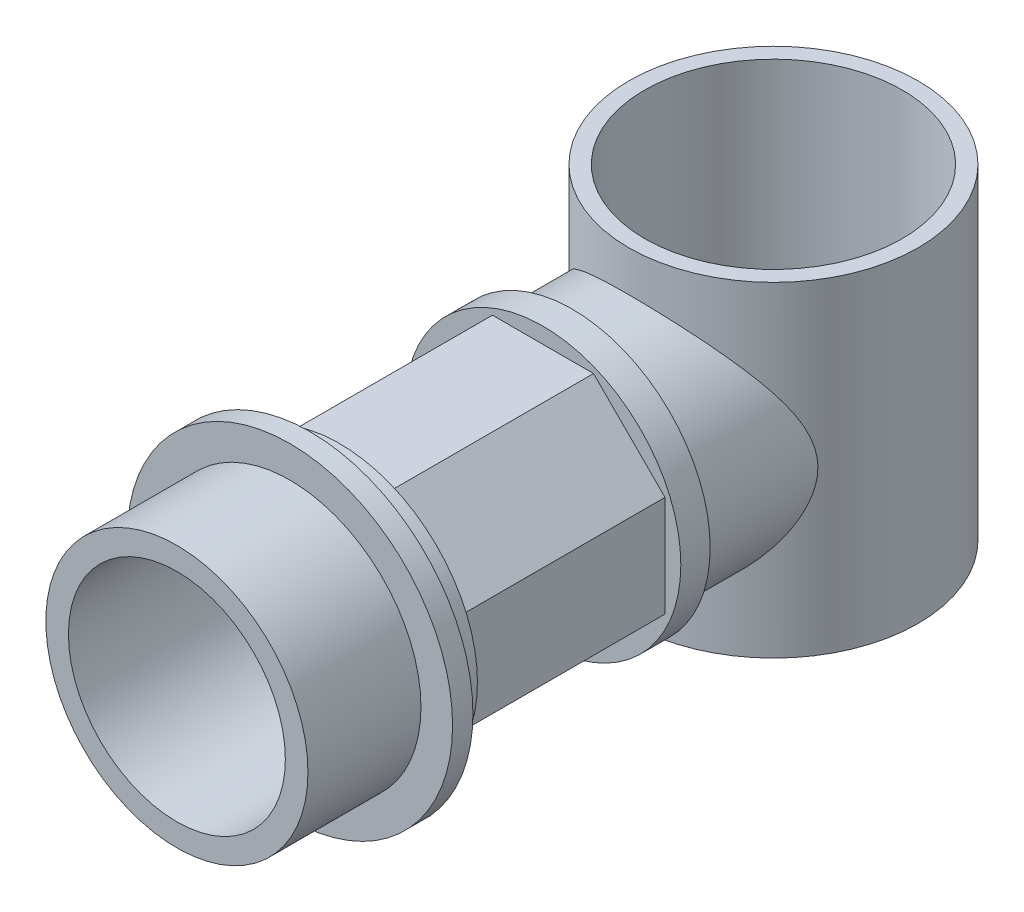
ISO-10303-21;
HEADER;
FILE_DESCRIPTION(('STEP AP214'),'2;1');
FILE_NAME('part.step','',(''),(''),'','','');
FILE_SCHEMA(('AUTOMOTIVE_DESIGN { 1 0 10303 214 1 1 1 1 }'));
ENDSEC;
DATA;
#1=APPLICATION_CONTEXT('core data for automotive mechanical design processes');
#2=APPLICATION_PROTOCOL_DEFINITION('international standard','automotive_design',2000,#1);
#3=PRODUCT_CONTEXT('',#1,'mechanical');
#4=PRODUCT('Part','Part','',(#3));
#5=PRODUCT_RELATED_PRODUCT_CATEGORY('part','',(#4));
#6=PRODUCT_DEFINITION_FORMATION('','',#4);
#7=PRODUCT_DEFINITION_CONTEXT('part definition',#1,'design');
#8=PRODUCT_DEFINITION('design','',#6,#7);
#9=PRODUCT_DEFINITION_SHAPE('','',#8);
#10=(LENGTH_UNIT() NAMED_UNIT(*) SI_UNIT(.MILLI.,.METRE.));
#11=(NAMED_UNIT(*) PLANE_ANGLE_UNIT() SI_UNIT($,.RADIAN.));
#12=(NAMED_UNIT(*) SI_UNIT($,.STERADIAN.) SOLID_ANGLE_UNIT());
#13=UNCERTAINTY_MEASURE_WITH_UNIT(LENGTH_MEASURE(1.E-05),#10,'distance_accuracy_value','');
#14=(GEOMETRIC_REPRESENTATION_CONTEXT(3) GLOBAL_UNCERTAINTY_ASSIGNED_CONTEXT((#13)) GLOBAL_UNIT_ASSIGNED_CONTEXT((#10,
#11,#12)) REPRESENTATION_CONTEXT('',''));
#15=CARTESIAN_POINT('',(0.,0.,0.));
#16=DIRECTION('',(0.,0.,1.));
#17=DIRECTION('',(1.,0.,0.));
#18=AXIS2_PLACEMENT_3D('',#15,#16,#17);
#19=CARTESIAN_POINT('',(0.,0.,-25.));
#20=DIRECTION('',(0.,0.,1.));
#21=DIRECTION('',(1.,0.,0.));
#22=AXIS2_PLACEMENT_3D('',#19,#20,#21);
#23=CYLINDRICAL_SURFACE('',#22,24.);
#24=CARTESIAN_POINT('',(0.,0.,0.));
#25=DIRECTION('',(0.,0.,1.));
#26=DIRECTION('',(1.,0.,0.));
#27=AXIS2_PLACEMENT_3D('',#24,#25,#26);
#28=CIRCLE('',#27,24.);
#29=CARTESIAN_POINT('',(24.,0.,0.));
#30=VERTEX_POINT('',#29);
#31=EDGE_CURVE('E158',#30,#30,#28,.T.);
#32=ORIENTED_EDGE('',*,*,#31,.T.);
#33=EDGE_LOOP('',(#32));
#34=FACE_BOUND('',#33,.T.);
#35=CARTESIAN_POINT('',(24.,0.,-116.629573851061));
#36=CARTESIAN_POINT('',(23.9999960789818,0.41664673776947,-116.629563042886));
#37=CARTESIAN_POINT('',(23.989119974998,0.833374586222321,-116.612544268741));
#38=CARTESIAN_POINT('',(23.9459109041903,1.66318601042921,-116.545393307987));
#39=CARTESIAN_POINT('',(23.9135654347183,2.07626732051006,-116.495241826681));
#40=CARTESIAN_POINT('',(23.8281651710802,2.89637383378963,-116.364315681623));
#41=CARTESIAN_POINT('',(23.7750585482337,3.30338121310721,-116.283464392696));
#42=CARTESIAN_POINT('',(23.6492968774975,4.10813094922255,-116.094857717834));
#43=CARTESIAN_POINT('',(23.5766339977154,4.50586952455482,-115.987091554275));
#44=CARTESIAN_POINT('',(23.4376328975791,5.17262033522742,-115.784650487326));
#45=CARTESIAN_POINT('',(23.3759529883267,5.44440663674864,-115.695769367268));
#46=CARTESIAN_POINT('',(23.24408516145,5.98240582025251,-115.508315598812));
#47=CARTESIAN_POINT('',(23.1738997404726,6.24862031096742,-115.409745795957));
#48=CARTESIAN_POINT('',(22.9510383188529,7.03916333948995,-115.101360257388));
#49=CARTESIAN_POINT('',(22.7861020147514,7.55517888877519,-114.878934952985));
#50=CARTESIAN_POINT('',(22.4255774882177,8.56636072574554,-114.409337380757));
#51=CARTESIAN_POINT('',(22.2299054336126,9.06146514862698,-114.162098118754));
#52=CARTESIAN_POINT('',(21.8098846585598,10.0303364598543,-113.650930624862));
#53=CARTESIAN_POINT('',(21.5855374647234,10.5041044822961,-113.387003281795));
#54=CARTESIAN_POINT('',(21.172145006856,11.3087259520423,-112.919634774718));
#55=CARTESIAN_POINT('',(20.9894239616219,11.6442790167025,-112.718627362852));
#56=CARTESIAN_POINT('',(20.6092701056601,12.3045967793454,-112.312812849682));
#57=CARTESIAN_POINT('',(20.4118361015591,12.6293605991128,-112.108005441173));
#58=CARTESIAN_POINT('',(19.7975772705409,13.5879532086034,-111.490423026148));
#59=CARTESIAN_POINT('',(19.3588579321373,14.2059622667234,-111.07455942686));
#60=CARTESIAN_POINT('',(18.424213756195,15.3987585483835,-110.247114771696));
#61=CARTESIAN_POINT('',(17.9283445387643,15.973586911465,-109.835529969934));
#62=CARTESIAN_POINT('',(16.8790139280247,17.0786111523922,-109.026373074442));
#63=CARTESIAN_POINT('',(16.3255752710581,17.6088245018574,-108.628795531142));
#64=CARTESIAN_POINT('',(15.2869065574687,18.5115132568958,-107.940479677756));
#65=CARTESIAN_POINT('',(14.8127621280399,18.8933234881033,-107.645212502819));
#66=CARTESIAN_POINT('',(13.829298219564,19.6246253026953,-107.073631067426));
#67=CARTESIAN_POINT('',(13.3199800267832,19.9741180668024,-106.797316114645));
#68=CARTESIAN_POINT('',(12.2676664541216,20.6371161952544,-106.268683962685));
#69=CARTESIAN_POINT('',(11.7247165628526,20.9506686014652,-106.016335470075));
#70=CARTESIAN_POINT('',(10.6060866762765,21.5385679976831,-105.540025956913));
#71=CARTESIAN_POINT('',(10.0304127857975,21.8129222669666,-105.316059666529));
#72=CARTESIAN_POINT('',(8.9528111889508,22.2739232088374,-104.937784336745));
#73=CARTESIAN_POINT('',(8.45571312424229,22.4675096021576,-104.77815156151));
#74=CARTESIAN_POINT('',(7.44306544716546,22.8229843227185,-104.48402933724));
#75=CARTESIAN_POINT('',(6.92751780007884,22.9848760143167,-104.349537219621));
#76=CARTESIAN_POINT('',(5.88083012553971,23.274676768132,-104.108170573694));
#77=CARTESIAN_POINT('',(5.3496963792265,23.4025993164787,-104.001285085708));
#78=CARTESIAN_POINT('',(4.27495115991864,23.6225658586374,-103.817168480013));
#79=CARTESIAN_POINT('',(3.73133954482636,23.714609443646,-103.739937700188));
#80=CARTESIAN_POINT('',(2.63311122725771,23.861579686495,-103.616494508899));
#81=CARTESIAN_POINT('',(2.07845628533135,23.9163391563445,-103.570421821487));
#82=CARTESIAN_POINT('',(0.964921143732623,23.98708299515,-103.510883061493));
#83=CARTESIAN_POINT('',(0.406040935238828,24.0030672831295,-103.497417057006));
#84=CARTESIAN_POINT('',(-0.71126828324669,23.9959622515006,-103.503400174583));
#85=CARTESIAN_POINT('',(-1.26969731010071,23.9728744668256,-103.522848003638));
#86=CARTESIAN_POINT('',(-2.38149301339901,23.8880575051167,-103.594212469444));
#87=CARTESIAN_POINT('',(-2.93485987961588,23.8263297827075,-103.646127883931));
#88=CARTESIAN_POINT('',(-3.99328093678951,23.6710637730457,-103.776470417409));
#89=CARTESIAN_POINT('',(-4.49898014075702,23.5800893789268,-103.852758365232));
#90=CARTESIAN_POINT('',(-5.49914338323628,23.3670886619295,-104.030955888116));
#91=CARTESIAN_POINT('',(-5.99360807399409,23.2450641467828,-104.132863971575));
#92=CARTESIAN_POINT('',(-6.9686813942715,22.9715892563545,-104.36056838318));
#93=CARTESIAN_POINT('',(-7.4492895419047,22.820137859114,-104.48636554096));
#94=CARTESIAN_POINT('',(-8.3944924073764,22.4896245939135,-104.759871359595));
#95=CARTESIAN_POINT('',(-8.85908612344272,22.3105610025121,-104.907581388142));
#96=CARTESIAN_POINT('',(-9.80805699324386,21.9109204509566,-105.235763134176));
#97=CARTESIAN_POINT('',(-10.2909187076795,21.688140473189,-105.417930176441));
#98=CARTESIAN_POINT('',(-11.2343250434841,21.2148184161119,-105.802681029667));
#99=CARTESIAN_POINT('',(-11.6948690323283,20.9642755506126,-106.005265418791));
#100=CARTESIAN_POINT('',(-12.5928736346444,20.4374823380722,-106.428218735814));
#101=CARTESIAN_POINT('',(-13.0303202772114,20.1612167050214,-106.648598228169));
#102=CARTESIAN_POINT('',(-13.8812472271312,19.585072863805,-107.104336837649));
#103=CARTESIAN_POINT('',(-14.2947227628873,19.2851899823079,-107.339698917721));
#104=CARTESIAN_POINT('',(-15.2927802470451,18.5121747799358,-107.940371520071));
#105=CARTESIAN_POINT('',(-15.8626622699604,18.025775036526,-108.313161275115));
#106=CARTESIAN_POINT('',(-16.9483550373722,17.0090240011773,-109.077428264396));
#107=CARTESIAN_POINT('',(-17.4641407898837,16.4786525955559,-109.468914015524));
#108=CARTESIAN_POINT('',(-18.4424305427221,15.3759881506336,-110.262382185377));
#109=CARTESIAN_POINT('',(-18.9048365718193,14.8036210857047,-110.664382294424));
#110=CARTESIAN_POINT('',(-19.7751516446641,13.6192308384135,-111.468464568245));
#111=CARTESIAN_POINT('',(-20.18307920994,13.0072212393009,-111.870546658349));
#112=CARTESIAN_POINT('',(-20.8493871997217,11.900014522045,-112.564883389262));
#113=CARTESIAN_POINT('',(-21.1197492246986,11.4135486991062,-112.859616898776));
#114=CARTESIAN_POINT('',(-21.6286691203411,10.4169970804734,-113.436633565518));
#115=CARTESIAN_POINT('',(-21.8672240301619,9.90690909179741,-113.718915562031));
#116=CARTESIAN_POINT('',(-22.310643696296,8.86317362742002,-114.262811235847));
#117=CARTESIAN_POINT('',(-22.5155870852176,8.32958495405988,-114.524472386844));
#118=CARTESIAN_POINT('',(-22.7964714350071,7.5102679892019,-114.894591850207));
#119=CARTESIAN_POINT('',(-22.885663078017,7.23406191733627,-115.014215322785));
#120=CARTESIAN_POINT('',(-23.0548884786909,6.67513369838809,-115.244626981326));
#121=CARTESIAN_POINT('',(-23.1349202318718,6.39241014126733,-115.355413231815));
#122=CARTESIAN_POINT('',(-23.3077354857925,5.73555090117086,-115.59793466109));
#123=CARTESIAN_POINT('',(-23.3972412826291,5.35921657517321,-115.726112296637));
#124=CARTESIAN_POINT('',(-23.558970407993,4.59639408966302,-115.961131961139));
#125=CARTESIAN_POINT('',(-23.6311998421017,4.20990957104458,-116.067981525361));
#126=CARTESIAN_POINT('',(-23.757122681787,3.42860397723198,-116.256367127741));
#127=CARTESIAN_POINT('',(-23.8108526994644,3.03380102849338,-116.337953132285));
#128=CARTESIAN_POINT('',(-23.8988628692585,2.23716096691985,-116.472576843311));
#129=CARTESIAN_POINT('',(-23.9331437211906,1.8353241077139,-116.525615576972));
#130=CARTESIAN_POINT('',(-23.9816147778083,1.02403405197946,-116.60083718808));
#131=CARTESIAN_POINT('',(-23.9956305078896,0.614545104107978,-116.622752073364));
#132=CARTESIAN_POINT('',(-24.002622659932,-0.205041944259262,-116.633668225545));
#133=CARTESIAN_POINT('',(-23.9955998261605,-0.615140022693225,-116.622670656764));
#134=CARTESIAN_POINT('',(-23.9606967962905,-1.43269163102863,-116.5683434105));
#135=CARTESIAN_POINT('',(-23.9327948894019,-1.8401419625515,-116.524980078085));
#136=CARTESIAN_POINT('',(-23.8568441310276,-2.64877798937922,-116.408150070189));
#137=CARTESIAN_POINT('',(-23.8087919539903,-3.0499626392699,-116.334678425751));
#138=CARTESIAN_POINT('',(-23.6805943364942,-3.93333038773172,-116.141382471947));
#139=CARTESIAN_POINT('',(-23.595651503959,-4.41334148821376,-116.014836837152));
#140=CARTESIAN_POINT('',(-23.3992929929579,-5.35779927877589,-115.728765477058));
#141=CARTESIAN_POINT('',(-23.287869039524,-5.82224105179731,-115.569229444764));
#142=CARTESIAN_POINT('',(-23.0402465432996,-6.73585229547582,-115.223757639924));
#143=CARTESIAN_POINT('',(-22.9039787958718,-7.18497483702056,-115.037748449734));
#144=CARTESIAN_POINT('',(-22.6085263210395,-8.06664402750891,-114.645901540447));
#145=CARTESIAN_POINT('',(-22.4493406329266,-8.49918998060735,-114.440062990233));
#146=CARTESIAN_POINT('',(-22.1424936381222,-9.26527735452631,-114.055414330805));
#147=CARTESIAN_POINT('',(-21.9986507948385,-9.60165960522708,-113.879174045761));
#148=CARTESIAN_POINT('',(-21.6973638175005,-10.2643492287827,-113.519482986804));
#149=CARTESIAN_POINT('',(-21.5399180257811,-10.5906553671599,-113.336031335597));
#150=CARTESIAN_POINT('',(-21.0475715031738,-11.555146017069,-112.777733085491));
#151=CARTESIAN_POINT('',(-20.6927286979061,-12.1787364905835,-112.395028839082));
#152=CARTESIAN_POINT('',(-19.9310922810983,-13.3889221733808,-111.621159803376));
#153=CARTESIAN_POINT('',(-19.5242339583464,-13.9754699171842,-111.229984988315));
#154=CARTESIAN_POINT('',(-18.659373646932,-15.1108174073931,-110.449663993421));
#155=CARTESIAN_POINT('',(-18.2013822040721,-15.6596248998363,-110.060517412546));
#156=CARTESIAN_POINT('',(-17.217828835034,-16.7360548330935,-109.279882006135));
#157=CARTESIAN_POINT('',(-16.6905104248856,-17.2623408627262,-108.888755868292));
#158=CARTESIAN_POINT('',(-15.5809483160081,-18.2700802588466,-108.126640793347));
#159=CARTESIAN_POINT('',(-14.9986942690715,-18.7515251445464,-107.75565567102));
#160=CARTESIAN_POINT('',(-13.7812305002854,-19.6635231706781,-107.043572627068));
#161=CARTESIAN_POINT('',(-13.1461693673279,-20.0942113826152,-106.702396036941));
#162=CARTESIAN_POINT('',(-12.1546308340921,-20.6981812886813,-106.219188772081));
#163=CARTESIAN_POINT('',(-11.817685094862,-20.8924658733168,-106.06290249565));
#164=CARTESIAN_POINT('',(-11.1309697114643,-21.2662727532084,-105.760864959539));
#165=CARTESIAN_POINT('',(-10.7811971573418,-21.4457916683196,-105.615116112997));
#166=CARTESIAN_POINT('',(-9.9448623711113,-21.8491217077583,-105.286406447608));
#167=CARTESIAN_POINT('',(-9.4532469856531,-22.0664620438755,-105.108261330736));
#168=CARTESIAN_POINT('',(-8.44957457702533,-22.4699161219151,-104.776223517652));
#169=CARTESIAN_POINT('',(-7.93752315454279,-22.6560383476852,-104.622324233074));
#170=CARTESIAN_POINT('',(-6.89545250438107,-22.9946224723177,-104.341480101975));
#171=CARTESIAN_POINT('',(-6.36544232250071,-23.1471010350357,-104.214521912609));
#172=CARTESIAN_POINT('',(-5.29026037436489,-23.4162385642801,-103.989917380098));
#173=CARTESIAN_POINT('',(-4.74508815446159,-23.5328964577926,-103.892271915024));
#174=CARTESIAN_POINT('',(-3.6402361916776,-23.7289945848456,-103.727888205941));
#175=CARTESIAN_POINT('',(-3.0804922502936,-23.8082224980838,-103.661326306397));
#176=CARTESIAN_POINT('',(-1.95384994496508,-23.9270411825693,-103.561430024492));
#177=CARTESIAN_POINT('',(-1.38695160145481,-23.9666320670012,-103.52809554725));
#178=CARTESIAN_POINT('',(-0.250874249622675,-24.0054173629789,-103.495439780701));
#179=CARTESIAN_POINT('',(0.318304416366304,-24.0046176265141,-103.496113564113));
#180=CARTESIAN_POINT('',(1.4540851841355,-23.9626486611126,-103.531448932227));
#181=CARTESIAN_POINT('',(2.02068742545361,-23.9214816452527,-103.566108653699));
#182=CARTESIAN_POINT('',(3.09879054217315,-23.8047504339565,-103.664240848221));
#183=CARTESIAN_POINT('',(3.61089109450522,-23.7323975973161,-103.725022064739));
#184=CARTESIAN_POINT('',(4.62557181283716,-23.5556630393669,-103.873198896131));
#185=CARTESIAN_POINT('',(5.12815262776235,-23.4512835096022,-103.960592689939));
#186=CARTESIAN_POINT('',(6.12089414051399,-23.2119669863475,-104.160440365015));
#187=CARTESIAN_POINT('',(6.6110540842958,-23.0770281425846,-104.272895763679));
#188=CARTESIAN_POINT('',(7.57647909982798,-22.7783303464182,-104.521000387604));
#189=CARTESIAN_POINT('',(8.05174329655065,-22.6145697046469,-104.656650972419));
#190=CARTESIAN_POINT('',(9.01260901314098,-22.249767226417,-104.957609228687));
#191=CARTESIAN_POINT('',(9.49719814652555,-22.0471086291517,-105.124184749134));
#192=CARTESIAN_POINT('',(10.4456840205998,-21.6138745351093,-105.478423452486));
#193=CARTESIAN_POINT('',(10.9095805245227,-21.3832987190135,-105.666086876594));
#194=CARTESIAN_POINT('',(11.8156307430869,-20.8963036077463,-106.059973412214));
#195=CARTESIAN_POINT('',(12.2577758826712,-20.6398742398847,-106.266203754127));
#196=CARTESIAN_POINT('',(13.1193727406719,-20.1032273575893,-106.694592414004));
#197=CARTESIAN_POINT('',(13.5388198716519,-19.8230050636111,-106.916753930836));
#198=CARTESIAN_POINT('',(14.5513088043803,-19.1000359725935,-107.484904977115));
#199=CARTESIAN_POINT('',(15.1304901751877,-18.6440945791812,-107.838932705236));
#200=CARTESIAN_POINT('',(16.2372679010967,-17.6885870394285,-108.568381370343));
#201=CARTESIAN_POINT('',(16.7648416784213,-17.1890019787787,-108.943811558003));
#202=CARTESIAN_POINT('',(17.7693803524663,-16.1484771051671,-109.708779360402));
#203=CARTESIAN_POINT('',(18.2462250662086,-15.6074440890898,-110.098347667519));
#204=CARTESIAN_POINT('',(19.1478922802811,-14.4870734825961,-110.882122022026));
#205=CARTESIAN_POINT('',(19.5727279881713,-13.9077456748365,-111.276326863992));
#206=CARTESIAN_POINT('',(20.3093212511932,-12.802443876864,-111.999854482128));
#207=CARTESIAN_POINT('',(20.6284401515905,-12.2818286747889,-112.329894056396));
#208=CARTESIAN_POINT('',(21.2286796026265,-11.2124584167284,-112.97926043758));
#209=CARTESIAN_POINT('',(21.5097929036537,-10.6636980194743,-113.298585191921));
#210=CARTESIAN_POINT('',(22.0319591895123,-9.53817877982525,-113.916692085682));
#211=CARTESIAN_POINT('',(22.2731043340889,-8.96148842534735,-114.215520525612));
#212=CARTESIAN_POINT('',(22.7136051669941,-7.77756676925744,-114.781680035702));
#213=CARTESIAN_POINT('',(22.9129904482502,-7.17035747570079,-115.049033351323));
#214=CARTESIAN_POINT('',(23.1980909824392,-6.16495547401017,-115.443036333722));
#215=CARTESIAN_POINT('',(23.2979926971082,-5.77644145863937,-115.584191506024));
#216=CARTESIAN_POINT('',(23.4794517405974,-4.98788350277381,-115.844798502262));
#217=CARTESIAN_POINT('',(23.561008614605,-4.58783927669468,-115.964249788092));
#218=CARTESIAN_POINT('',(23.704213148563,-3.77869009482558,-116.176704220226));
#219=CARTESIAN_POINT('',(23.7659263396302,-3.36961983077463,-116.269794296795));
#220=CARTESIAN_POINT('',(23.8684832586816,-2.54333395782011,-116.425844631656));
#221=CARTESIAN_POINT('',(23.9093405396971,-2.1261238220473,-116.488824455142));
#222=CARTESIAN_POINT('',(23.9594208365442,-1.42358915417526,-116.566352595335));
#223=CARTESIAN_POINT('',(23.9746163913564,-1.13966334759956,-116.589999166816));
#224=CARTESIAN_POINT('',(23.9949085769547,-0.570504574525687,-116.6216154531));
#225=CARTESIAN_POINT('',(24.0000026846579,-0.285271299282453,-116.629581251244));
#226=CARTESIAN_POINT('',(24.,0.,-116.629573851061));
#227=B_SPLINE_CURVE_WITH_KNOTS('',3,(#35,#36,#37,#38,#39,#40,#41,#42,#43,#44,#45,#46,#47,#48,
#49,#50,#51,#52,#53,#54,#55,#56,#57,#58,#59,#60,#61,#62,#63,#64,#65,#66,#67,#68,#69,#70,#71,#72,
#73,#74,#75,#76,#77,#78,#79,#80,#81,#82,#83,#84,#85,#86,#87,#88,#89,#90,#91,#92,#93,#94,#95,#96,
#97,#98,#99,#100,#101,#102,#103,#104,#105,#106,#107,#108,#109,#110,#111,#112,#113,#114,#115,
#116,#117,#118,#119,#120,#121,#122,#123,#124,#125,#126,#127,#128,#129,#130,#131,#132,#133,#134,
#135,#136,#137,#138,#139,#140,#141,#142,#143,#144,#145,#146,#147,#148,#149,#150,#151,#152,#153,
#154,#155,#156,#157,#158,#159,#160,#161,#162,#163,#164,#165,#166,#167,#168,#169,#170,#171,#172,
#173,#174,#175,#176,#177,#178,#179,#180,#181,#182,#183,#184,#185,#186,#187,#188,#189,#190,#191,
#192,#193,#194,#195,#196,#197,#198,#199,#200,#201,#202,#203,#204,#205,#206,#207,#208,#209,#210,
#211,#212,#213,#214,#215,#216,#217,#218,#219,#220,#221,#222,#223,#224,#225,#226),.UNSPECIFIED.,
.T.,.F.,(4,2,2,2,2,2,2,2,2,2,2,2,2,2,2,2,2,2,2,2,2,2,2,2,2,2,2,2,2,2,2,2,2,2,2,2,2,2,2,2,2,2,2,
2,2,2,2,2,2,2,2,2,2,2,2,2,2,2,2,2,2,2,2,2,2,2,2,2,2,2,2,2,2,2,2,2,2,2,2,2,2,2,2,2,2,2,2,2,2,2,2,
2,2,2,2,4),(0.,1.24960659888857,2.49994154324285,3.75341799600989,5.0073971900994,
5.88464311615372,6.76163216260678,8.51628925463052,10.275818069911,12.0352532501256,
13.3300319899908,14.6249158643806,17.2151432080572,19.8028706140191,22.3895798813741,
24.4175985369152,26.4455430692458,28.4708021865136,30.4956847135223,32.164551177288,
33.8332403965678,35.5012661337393,37.169310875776,38.8447869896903,40.5202666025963,
42.1956803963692,43.871031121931,45.4276725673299,46.9842234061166,48.5408283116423,
50.0975304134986,51.7822608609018,53.4670390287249,55.152824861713,56.8389451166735,
59.3459523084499,61.8541126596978,64.366805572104,66.8786420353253,68.7667401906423,
70.6550139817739,72.5388052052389,73.4803367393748,74.4220739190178,75.6436545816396,
76.8648028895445,78.0835203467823,79.3021939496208,80.5312986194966,81.7603598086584,
82.9907007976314,84.2212449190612,85.7297293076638,87.2386856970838,88.7519114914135,
90.2652007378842,91.4830192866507,92.7009864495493,95.1375148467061,97.5771045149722,
100.016191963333,102.537443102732,105.059170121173,107.57402718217,108.8310449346,
110.088349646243,111.785432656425,113.482053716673,115.177832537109,116.873662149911,
118.578999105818,120.284331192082,121.989416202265,123.694407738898,125.254880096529,
126.815245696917,128.375705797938,129.936257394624,131.587778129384,133.239317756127,
134.89150333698,136.544021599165,138.99366503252,141.444375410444,143.900768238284,
146.356535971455,148.437356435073,150.518573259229,152.594922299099,154.669794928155,
155.944667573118,157.219571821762,158.490221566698,159.760044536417,160.615416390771,
161.471001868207),.UNSPECIFIED.);
#228=CARTESIAN_POINT('',(24.,0.,-116.629573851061));
#229=VERTEX_POINT('',#228);
#230=EDGE_CURVE('E260',#229,#229,#227,.T.);
#231=ORIENTED_EDGE('',*,*,#230,.F.);
#232=EDGE_LOOP('',(#231));
#233=FACE_BOUND('',#232,.T.);
#234=ADVANCED_FACE('F32',(#34,#233),#23,.F.);
#235=CARTESIAN_POINT('',(0.,0.,-137.5));
#236=DIRECTION('',(0.,0.,1.));
#237=DIRECTION('',(1.,0.,0.));
#238=AXIS2_PLACEMENT_3D('',#235,#236,#237);
#239=CYLINDRICAL_SURFACE('',#238,27.);
#240=CARTESIAN_POINT('',(0.,0.,-87.5));
#241=DIRECTION('',(0.,0.,-1.));
#242=DIRECTION('',(-1.,0.,0.));
#243=AXIS2_PLACEMENT_3D('',#240,#241,#242);
#244=CIRCLE('',#243,27.);
#245=CARTESIAN_POINT('',(-27.,0.,-87.5));
#246=VERTEX_POINT('',#245);
#247=EDGE_CURVE('E277',#246,#246,#244,.T.);
#248=ORIENTED_EDGE('',*,*,#247,.T.);
#249=EDGE_LOOP('',(#248));
#250=FACE_BOUND('',#249,.T.);
#251=CARTESIAN_POINT('',(27.,0.,-114.824435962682));
#252=CARTESIAN_POINT('',(27.0000015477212,-0.467338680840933,-114.82444020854));
#253=CARTESIAN_POINT('',(26.987836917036,-0.934658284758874,-114.805271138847));
#254=CARTESIAN_POINT('',(26.9395406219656,-1.864975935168,-114.729703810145));
#255=CARTESIAN_POINT('',(26.9034092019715,-2.32797402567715,-114.673305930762));
#256=CARTESIAN_POINT('',(26.8080084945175,-3.24729378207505,-114.526067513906));
#257=CARTESIAN_POINT('',(26.7486748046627,-3.70359316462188,-114.435131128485));
#258=CARTESIAN_POINT('',(26.6082039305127,-4.60564817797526,-114.223059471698));
#259=CARTESIAN_POINT('',(26.5270628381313,-5.05140190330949,-114.101918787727));
#260=CARTESIAN_POINT('',(26.3077453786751,-6.10724856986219,-113.780395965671));
#261=CARTESIAN_POINT('',(26.1597457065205,-6.71155737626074,-113.567718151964));
#262=CARTESIAN_POINT('',(25.8272312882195,-7.89509259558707,-113.104621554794));
#263=CARTESIAN_POINT('',(25.6426985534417,-8.47430648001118,-112.854184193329));
#264=CARTESIAN_POINT('',(25.2393240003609,-9.60938183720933,-112.325463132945));
#265=CARTESIAN_POINT('',(25.0203936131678,-10.1651781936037,-112.04710823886));
#266=CARTESIAN_POINT('',(24.5504523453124,-11.252833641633,-111.47164633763));
#267=CARTESIAN_POINT('',(24.2994429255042,-11.7846938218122,-111.174540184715));
#268=CARTESIAN_POINT('',(23.8362215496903,-12.6893995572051,-110.647635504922));
#269=CARTESIAN_POINT('',(23.6310285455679,-13.0674577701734,-110.420552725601));
#270=CARTESIAN_POINT('',(23.2040615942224,-13.8114248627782,-109.962084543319));
#271=CARTESIAN_POINT('',(22.982286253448,-14.1773327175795,-109.730698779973));
#272=CARTESIAN_POINT('',(22.2922114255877,-15.2573907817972,-109.032962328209));
#273=CARTESIAN_POINT('',(21.799233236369,-15.9537390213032,-108.563113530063));
#274=CARTESIAN_POINT('',(20.7487256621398,-17.2978954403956,-107.628192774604));
#275=CARTESIAN_POINT('',(20.191253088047,-17.9457455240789,-107.163117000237));
#276=CARTESIAN_POINT('',(19.0113320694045,-19.1912618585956,-106.248768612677));
#277=CARTESIAN_POINT('',(18.3889094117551,-19.7889478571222,-105.799489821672));
#278=CARTESIAN_POINT('',(17.2210605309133,-20.8061939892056,-105.021952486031));
#279=CARTESIAN_POINT('',(16.6881856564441,-21.2362838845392,-104.688569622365));
#280=CARTESIAN_POINT('',(15.5827918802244,-22.0601825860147,-104.043139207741));
#281=CARTESIAN_POINT('',(15.0102744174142,-22.453992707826,-103.731090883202));
#282=CARTESIAN_POINT('',(13.8272783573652,-23.2011882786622,-103.134020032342));
#283=CARTESIAN_POINT('',(13.2168521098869,-23.5546276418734,-102.848961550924));
#284=CARTESIAN_POINT('',(11.9590718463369,-24.2174651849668,-102.310806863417));
#285=CARTESIAN_POINT('',(11.3117247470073,-24.526871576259,-102.057704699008));
#286=CARTESIAN_POINT('',(10.1001996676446,-25.0467677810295,-101.63023281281));
#287=CARTESIAN_POINT('',(9.54149053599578,-25.2650789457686,-101.449850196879));
#288=CARTESIAN_POINT('',(8.40324716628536,-25.6661137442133,-101.117370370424));
#289=CARTESIAN_POINT('',(7.8237151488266,-25.8488411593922,-100.965270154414));
#290=CARTESIAN_POINT('',(6.64702661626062,-26.1761300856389,-100.692147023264));
#291=CARTESIAN_POINT('',(6.04987710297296,-26.3207065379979,-100.571111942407));
#292=CARTESIAN_POINT('',(4.84145063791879,-26.5695475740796,-100.36242327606));
#293=CARTESIAN_POINT('',(4.23017352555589,-26.6738116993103,-100.274770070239));
#294=CARTESIAN_POINT('',(2.99511951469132,-26.8406269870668,-100.134388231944));
#295=CARTESIAN_POINT('',(2.37129878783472,-26.9029885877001,-100.081818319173));
#296=CARTESIAN_POINT('',(1.1188057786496,-26.9841079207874,-100.013415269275));
#297=CARTESIAN_POINT('',(0.490133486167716,-27.0028655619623,-99.9975822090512));
#298=CARTESIAN_POINT('',(-0.766792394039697,-26.996425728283,-100.003015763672));
#299=CARTESIAN_POINT('',(-1.39504599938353,-26.9712302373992,-100.024280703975));
#300=CARTESIAN_POINT('',(-2.64593977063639,-26.8773578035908,-100.103421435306));
#301=CARTESIAN_POINT('',(-3.26858015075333,-26.8086825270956,-100.161295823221));
#302=CARTESIAN_POINT('',(-4.45914574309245,-26.6355334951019,-100.306946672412));
#303=CARTESIAN_POINT('',(-5.02779868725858,-26.5339721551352,-100.392287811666));
#304=CARTESIAN_POINT('',(-6.15253153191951,-26.2959456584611,-100.591839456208));
#305=CARTESIAN_POINT('',(-6.70861216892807,-26.1594825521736,-100.706048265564));
#306=CARTESIAN_POINT('',(-7.80524649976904,-25.8534764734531,-100.961392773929));
#307=CARTESIAN_POINT('',(-8.34579962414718,-25.6839322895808,-101.102529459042));
#308=CARTESIAN_POINT('',(-9.40894427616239,-25.3138036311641,-101.409511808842));
#309=CARTESIAN_POINT('',(-9.93153468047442,-25.1132172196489,-101.575359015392));
#310=CARTESIAN_POINT('',(-10.9986883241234,-24.6655716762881,-101.943836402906));
#311=CARTESIAN_POINT('',(-11.5415642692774,-24.4160558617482,-102.148363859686));
#312=CARTESIAN_POINT('',(-12.6022906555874,-23.8858516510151,-102.580443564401));
#313=CARTESIAN_POINT('',(-13.1201404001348,-23.6051623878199,-102.807996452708));
#314=CARTESIAN_POINT('',(-14.1299294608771,-23.0149372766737,-103.28316404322));
#315=CARTESIAN_POINT('',(-14.6218534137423,-22.7053846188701,-103.530790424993));
#316=CARTESIAN_POINT('',(-15.5788537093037,-22.0597501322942,-104.042998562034));
#317=CARTESIAN_POINT('',(-16.0439246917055,-21.7236630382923,-104.307583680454));
#318=CARTESIAN_POINT('',(-16.8314126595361,-21.1159609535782,-104.78130384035));
#319=CARTESIAN_POINT('',(-17.1599317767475,-20.8497973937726,-104.987345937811));
#320=CARTESIAN_POINT('',(-17.8016844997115,-20.3046116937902,-105.405887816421));
#321=CARTESIAN_POINT('',(-18.1149205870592,-20.0255916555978,-105.618386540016));
#322=CARTESIAN_POINT('',(-19.0320514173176,-19.1697861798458,-106.264034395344));
#323=CARTESIAN_POINT('',(-19.6131721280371,-18.5744077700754,-106.705215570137));
#324=CARTESIAN_POINT('',(-20.7154062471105,-17.3366736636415,-107.599656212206));
#325=CARTESIAN_POINT('',(-21.2364070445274,-16.6942333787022,-108.052936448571));
#326=CARTESIAN_POINT('',(-22.2171954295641,-15.3648438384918,-108.959996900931));
#327=CARTESIAN_POINT('',(-22.6770035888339,-14.6779096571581,-109.413776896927));
#328=CARTESIAN_POINT('',(-23.4298745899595,-13.4325337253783,-110.199529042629));
#329=CARTESIAN_POINT('',(-23.7362164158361,-12.8837506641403,-110.534151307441));
#330=CARTESIAN_POINT('',(-24.3128609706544,-11.7594261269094,-111.189541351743));
#331=CARTESIAN_POINT('',(-24.5831601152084,-11.1838819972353,-111.510307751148));
#332=CARTESIAN_POINT('',(-25.0856006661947,-10.0060732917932,-112.128644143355));
#333=CARTESIAN_POINT('',(-25.3178315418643,-9.40387571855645,-112.426267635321));
#334=CARTESIAN_POINT('',(-25.6361413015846,-8.47905618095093,-112.847470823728));
#335=CARTESIAN_POINT('',(-25.737221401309,-8.16725974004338,-112.983642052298));
#336=CARTESIAN_POINT('',(-25.9290134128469,-7.53624878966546,-113.245996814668));
#337=CARTESIAN_POINT('',(-26.0197230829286,-7.2170326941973,-113.372178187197));
#338=CARTESIAN_POINT('',(-26.214744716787,-6.47857064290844,-113.647257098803));
#339=CARTESIAN_POINT('',(-26.3154870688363,-6.05691353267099,-113.792278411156));
#340=CARTESIAN_POINT('',(-26.4977041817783,-5.20216413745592,-114.05849158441));
#341=CARTESIAN_POINT('',(-26.5791857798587,-4.76907597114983,-114.179691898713));
#342=CARTESIAN_POINT('',(-26.7214739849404,-3.89346809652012,-114.393769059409));
#343=CARTESIAN_POINT('',(-26.7823217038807,-3.4509690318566,-114.486702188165));
#344=CARTESIAN_POINT('',(-26.8823110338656,-2.55795708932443,-114.640569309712));
#345=CARTESIAN_POINT('',(-26.9214534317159,-2.10744450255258,-114.701504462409));
#346=CARTESIAN_POINT('',(-26.9773084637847,-1.19762445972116,-114.788736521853));
#347=CARTESIAN_POINT('',(-26.9938209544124,-0.738274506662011,-114.814724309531));
#348=CARTESIAN_POINT('',(-27.0033061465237,0.181260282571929,-114.829631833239));
#349=CARTESIAN_POINT('',(-26.9962797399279,0.641445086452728,-114.818552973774));
#350=CARTESIAN_POINT('',(-26.9588702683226,1.55896120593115,-114.759916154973));
#351=CARTESIAN_POINT('',(-26.9284635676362,2.01628916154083,-114.712321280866));
#352=CARTESIAN_POINT('',(-26.8450754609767,2.92400439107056,-114.583118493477));
#353=CARTESIAN_POINT('',(-26.7920903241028,3.3743905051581,-114.50150495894));
#354=CARTESIAN_POINT('',(-26.6506651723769,4.3639397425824,-114.286671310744));
#355=CARTESIAN_POINT('',(-26.5569787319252,4.9007367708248,-114.146033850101));
#356=CARTESIAN_POINT('',(-26.3401726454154,5.95704276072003,-113.82770661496));
#357=CARTESIAN_POINT('',(-26.2170439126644,6.47654632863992,-113.650005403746));
#358=CARTESIAN_POINT('',(-25.9432448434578,7.49858441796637,-113.264899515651));
#359=CARTESIAN_POINT('',(-25.7924970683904,8.00106639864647,-113.057411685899));
#360=CARTESIAN_POINT('',(-25.4655331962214,8.98758667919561,-112.620084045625));
#361=CARTESIAN_POINT('',(-25.2893160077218,9.47162418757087,-112.390243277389));
#362=CARTESIAN_POINT('',(-24.9488685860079,10.3307596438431,-111.959685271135));
#363=CARTESIAN_POINT('',(-24.7888085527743,10.7089640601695,-111.761823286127));
#364=CARTESIAN_POINT('',(-24.45344773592,11.454072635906,-111.357861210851));
#365=CARTESIAN_POINT('',(-24.278145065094,11.8209753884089,-111.151760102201));
#366=CARTESIAN_POINT('',(-23.7298237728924,12.9055216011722,-110.524351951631));
#367=CARTESIAN_POINT('',(-23.334468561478,13.6068108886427,-110.094038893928));
#368=CARTESIAN_POINT('',(-22.4855940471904,14.9680357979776,-109.223505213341));
#369=CARTESIAN_POINT('',(-22.0320015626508,15.6279178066,-108.783272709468));
#370=CARTESIAN_POINT('',(-21.0675668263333,16.905560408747,-107.904707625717));
#371=CARTESIAN_POINT('',(-20.5567365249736,17.5233297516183,-107.466374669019));
#372=CARTESIAN_POINT('',(-19.4585896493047,18.7364891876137,-106.585909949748));
#373=CARTESIAN_POINT('',(-18.8692075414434,19.3303160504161,-106.144191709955));
#374=CARTESIAN_POINT('',(-17.6287138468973,20.4679469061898,-105.282985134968));
#375=CARTESIAN_POINT('',(-16.9775905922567,21.0117414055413,-104.863501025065));
#376=CARTESIAN_POINT('',(-15.6157348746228,22.0425864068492,-104.057690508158));
#377=CARTESIAN_POINT('',(-14.9051678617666,22.5297859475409,-103.671277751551));
#378=CARTESIAN_POINT('',(-13.7954041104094,23.2136946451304,-103.123415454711));
#379=CARTESIAN_POINT('',(-13.4182285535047,23.4338172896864,-102.94611361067));
#380=CARTESIAN_POINT('',(-12.6494023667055,23.8576049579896,-102.603235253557));
#381=CARTESIAN_POINT('',(-12.2577484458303,24.0612662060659,-102.437661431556));
#382=CARTESIAN_POINT('',(-11.3196893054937,24.5198923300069,-102.063369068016));
#383=CARTESIAN_POINT('',(-10.767503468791,24.767556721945,-101.86007845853));
#384=CARTESIAN_POINT('',(-9.63982940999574,25.2278507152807,-101.480703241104));
#385=CARTESIAN_POINT('',(-9.06434756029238,25.4404898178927,-101.304611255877));
#386=CARTESIAN_POINT('',(-7.89281843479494,25.8279656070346,-100.982711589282));
#387=CARTESIAN_POINT('',(-7.29678138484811,26.0028207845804,-100.836889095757));
#388=CARTESIAN_POINT('',(-6.08726693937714,26.3122559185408,-100.578230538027));
#389=CARTESIAN_POINT('',(-5.47378903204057,26.4468346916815,-100.465395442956));
#390=CARTESIAN_POINT('',(-4.23000925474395,26.6741245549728,-100.27453570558));
#391=CARTESIAN_POINT('',(-3.5996308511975,26.7665901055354,-100.196715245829));
#392=CARTESIAN_POINT('',(-2.33040891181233,26.9068169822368,-100.078606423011));
#393=CARTESIAN_POINT('',(-1.69156539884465,26.9545784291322,-100.038317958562));
#394=CARTESIAN_POINT('',(-0.410942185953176,27.0044751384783,-99.9962268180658));
#395=CARTESIAN_POINT('',(0.230836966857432,27.0066185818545,-99.9944172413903));
#396=CARTESIAN_POINT('',(1.51184117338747,26.9652543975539,-100.029313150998));
#397=CARTESIAN_POINT('',(2.15106637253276,26.9217494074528,-100.066016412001));
#398=CARTESIAN_POINT('',(3.36616758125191,26.7956890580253,-100.172214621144));
#399=CARTESIAN_POINT('',(3.94271272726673,26.7168642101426,-100.238575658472));
#400=CARTESIAN_POINT('',(5.08533079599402,26.5231060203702,-100.401386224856));
#401=CARTESIAN_POINT('',(5.6514044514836,26.408175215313,-100.497833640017));
#402=CARTESIAN_POINT('',(6.76983148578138,26.1438266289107,-100.719104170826));
#403=CARTESIAN_POINT('',(7.32218279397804,25.9944036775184,-100.843931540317));
#404=CARTESIAN_POINT('',(8.41028985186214,25.6630188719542,-101.119874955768));
#405=CARTESIAN_POINT('',(8.94604462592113,25.4810551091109,-101.270992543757));
#406=CARTESIAN_POINT('',(10.0279807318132,25.075718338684,-101.60628416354));
#407=CARTESIAN_POINT('',(10.5730831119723,24.8506044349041,-101.79182978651));
#408=CARTESIAN_POINT('',(11.6402289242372,24.3689929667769,-102.186767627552));
#409=CARTESIAN_POINT('',(12.1622721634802,24.1124951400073,-102.396160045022));
#410=CARTESIAN_POINT('',(13.1818533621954,23.5705762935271,-102.835861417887));
#411=CARTESIAN_POINT('',(13.6793927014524,23.2851569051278,-103.066169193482));
#412=CARTESIAN_POINT('',(14.6491804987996,22.6875734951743,-103.544877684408));
#413=CARTESIAN_POINT('',(15.1214238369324,22.3754040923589,-103.793282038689));
#414=CARTESIAN_POINT('',(15.9209650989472,21.8104679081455,-104.238971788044));
#415=CARTESIAN_POINT('',(16.2541280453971,21.5632536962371,-104.432835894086));
#416=CARTESIAN_POINT('',(16.9060195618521,21.0560448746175,-104.827739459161));
#417=CARTESIAN_POINT('',(17.2247505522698,20.7960524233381,-105.028777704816));
#418=CARTESIAN_POINT('',(18.1595606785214,19.9975583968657,-105.641220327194));
#419=CARTESIAN_POINT('',(18.7540885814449,19.4406597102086,-106.061857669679));
#420=CARTESIAN_POINT('',(19.8877237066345,18.2794988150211,-106.920396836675));
#421=CARTESIAN_POINT('',(20.4265721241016,17.6750365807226,-107.358367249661));
#422=CARTESIAN_POINT('',(21.4460715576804,16.4230822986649,-108.240375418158));
#423=CARTESIAN_POINT('',(21.9267330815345,15.7755980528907,-108.684412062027));
#424=CARTESIAN_POINT('',(22.6081944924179,14.7661266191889,-109.351084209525));
#425=CARTESIAN_POINT('',(22.8306788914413,14.4197814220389,-109.575547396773));
#426=CARTESIAN_POINT('',(23.2603450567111,13.7159167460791,-110.021552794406));
#427=CARTESIAN_POINT('',(23.4675284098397,13.3583984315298,-110.243095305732));
#428=CARTESIAN_POINT('',(23.8665577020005,12.6316822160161,-110.681571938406));
#429=CARTESIAN_POINT('',(24.0583915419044,12.2624754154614,-110.898502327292));
#430=CARTESIAN_POINT('',(24.4262114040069,11.5123700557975,-111.325388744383));
#431=CARTESIAN_POINT('',(24.602199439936,11.1314729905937,-111.535345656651));
#432=CARTESIAN_POINT('',(24.9369798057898,10.3596815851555,-111.944662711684));
#433=CARTESIAN_POINT('',(25.095861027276,9.96885341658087,-112.14407458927));
#434=CARTESIAN_POINT('',(25.3969189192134,9.17479235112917,-112.530626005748));
#435=CARTESIAN_POINT('',(25.5390940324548,8.77155830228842,-112.717764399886));
#436=CARTESIAN_POINT('',(25.8057074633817,7.95301522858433,-113.076066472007));
#437=CARTESIAN_POINT('',(25.9301708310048,7.5377242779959,-113.247252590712));
#438=CARTESIAN_POINT('',(26.160535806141,6.69457286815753,-113.569978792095));
#439=CARTESIAN_POINT('',(26.266440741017,6.26671467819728,-113.721522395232));
#440=CARTESIAN_POINT('',(26.4653712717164,5.36758854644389,-114.010638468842));
#441=CARTESIAN_POINT('',(26.5569244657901,4.89541058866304,-114.146424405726));
#442=CARTESIAN_POINT('',(26.7155728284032,3.93867295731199,-114.38470146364));
#443=CARTESIAN_POINT('',(26.7826728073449,3.45411573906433,-114.487199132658));
#444=CARTESIAN_POINT('',(26.8905948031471,2.47718663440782,-114.653363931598));
#445=CARTESIAN_POINT('',(26.9315096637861,1.98484877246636,-114.71716821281));
#446=CARTESIAN_POINT('',(26.986210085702,0.994999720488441,-114.802699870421));
#447=CARTESIAN_POINT('',(26.9999983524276,0.497489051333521,-114.824431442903));
#448=CARTESIAN_POINT('',(27.,0.,-114.824435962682));
#449=B_SPLINE_CURVE_WITH_KNOTS('',3,(#251,#252,#253,#254,#255,#256,#257,#258,#259,#260,#261,
#262,#263,#264,#265,#266,#267,#268,#269,#270,#271,#272,#273,#274,#275,#276,#277,#278,#279,#280,
#281,#282,#283,#284,#285,#286,#287,#288,#289,#290,#291,#292,#293,#294,#295,#296,#297,#298,#299,
#300,#301,#302,#303,#304,#305,#306,#307,#308,#309,#310,#311,#312,#313,#314,#315,#316,#317,#318,
#319,#320,#321,#322,#323,#324,#325,#326,#327,#328,#329,#330,#331,#332,#333,#334,#335,#336,#337,
#338,#339,#340,#341,#342,#343,#344,#345,#346,#347,#348,#349,#350,#351,#352,#353,#354,#355,#356,
#357,#358,#359,#360,#361,#362,#363,#364,#365,#366,#367,#368,#369,#370,#371,#372,#373,#374,#375,
#376,#377,#378,#379,#380,#381,#382,#383,#384,#385,#386,#387,#388,#389,#390,#391,#392,#393,#394,
#395,#396,#397,#398,#399,#400,#401,#402,#403,#404,#405,#406,#407,#408,#409,#410,#411,#412,#413,
#414,#415,#416,#417,#418,#419,#420,#421,#422,#423,#424,#425,#426,#427,#428,#429,#430,#431,#432,
#433,#434,#435,#436,#437,#438,#439,#440,#441,#442,#443,#444,#445,#446,#447,#448),.UNSPECIFIED.,
.T.,.F.,(4,2,2,2,2,2,2,2,2,2,2,2,2,2,2,2,2,2,2,2,2,2,2,2,2,2,2,2,2,2,2,2,2,2,2,2,2,2,2,2,2,2,2,
2,2,2,2,2,2,2,2,2,2,2,2,2,2,2,2,2,2,2,2,2,2,2,2,2,2,2,2,2,2,2,2,2,2,2,2,2,2,2,2,2,2,2,2,2,2,2,2,
2,2,2,2,2,2,2,4),(0.,1.40144791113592,2.80288153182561,4.20823303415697,5.61383655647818,
7.58313450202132,9.55340453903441,11.5288334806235,13.5041724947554,14.9629624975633,
16.4218752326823,19.3402195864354,22.2560125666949,25.1706522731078,27.4535656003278,
29.7363961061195,32.0161413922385,34.2954609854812,36.1727650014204,38.0498694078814,
39.9262375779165,41.8026270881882,43.6874490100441,45.5722748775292,47.4570156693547,
49.3416842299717,51.0915271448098,52.8412672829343,54.5910715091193,56.3409849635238,
58.2337073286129,60.1264823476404,62.0203666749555,63.9146277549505,65.3251842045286,
66.7355108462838,69.5569893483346,72.383669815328,75.2093975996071,77.3440988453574,
79.4790122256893,81.6088338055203,82.673322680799,83.7380412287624,85.1083839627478,
86.4782395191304,87.8453494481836,89.2124098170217,90.5914843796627,91.9705066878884,
93.3509249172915,94.7315713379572,96.4171966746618,98.1033429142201,99.7942912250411,
101.485312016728,102.852398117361,104.219653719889,106.954850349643,109.693518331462,
112.431615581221,115.26651059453,118.101942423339,120.929729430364,122.34316570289,
123.756925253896,125.670240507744,127.583035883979,129.494893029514,131.406806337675,
133.329728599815,135.252645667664,137.1752178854,139.097679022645,140.852727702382,
142.607653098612,144.362841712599,146.11813331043,147.971106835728,149.824095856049,
151.676980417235,153.530238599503,154.903553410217,156.276637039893,159.02348378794,
161.78257253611,164.541162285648,165.947453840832,167.35359934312,168.760842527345,
170.167906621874,171.567265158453,172.966754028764,174.364243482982,175.761482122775,
177.259127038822,178.756477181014,180.248488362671,181.740350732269),.UNSPECIFIED.);
#450=CARTESIAN_POINT('',(27.,0.,-114.824435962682));
#451=VERTEX_POINT('',#450);
#452=EDGE_CURVE('E11',#451,#451,#449,.T.);
#453=ORIENTED_EDGE('',*,*,#452,.F.);
#454=EDGE_LOOP('',(#453));
#455=FACE_BOUND('',#454,.T.);
#456=ADVANCED_FACE('F178',(#250,#455),#239,.T.);
#457=CARTESIAN_POINT('',(0.,0.,-87.5));
#458=DIRECTION('',(0.,0.,-1.));
#459=DIRECTION('',(-1.,0.,0.));
#460=AXIS2_PLACEMENT_3D('',#457,#458,#459);
#461=PLANE('',#460);
#462=CARTESIAN_POINT('',(0.,0.,-87.5));
#463=DIRECTION('',(0.,0.,-1.));
#464=DIRECTION('',(-1.,0.,0.));
#465=AXIS2_PLACEMENT_3D('',#462,#463,#464);
#466=CIRCLE('',#465,30.5);
#467=CARTESIAN_POINT('',(30.5,0.,-87.5));
#468=VERTEX_POINT('',#467);
#469=EDGE_CURVE('E283',#468,#468,#466,.T.);
#470=ORIENTED_EDGE('',*,*,#469,.T.);
#471=EDGE_LOOP('',(#470));
#472=FACE_BOUND('',#471,.T.);
#473=ORIENTED_EDGE('',*,*,#247,.F.);
#474=EDGE_LOOP('',(#473));
#475=FACE_BOUND('',#474,.T.);
#476=ADVANCED_FACE('F184',(#472,#475),#461,.T.);
#477=CARTESIAN_POINT('',(0.,0.,-36.));
#478=DIRECTION('',(0.,0.,-1.));
#479=DIRECTION('',(-1.,0.,0.));
#480=AXIS2_PLACEMENT_3D('',#477,#478,#479);
#481=PLANE('',#480);
#482=CARTESIAN_POINT('',(0.,0.,-36.));
#483=DIRECTION('',(0.,0.,-1.));
#484=DIRECTION('',(-1.,0.,0.));
#485=AXIS2_PLACEMENT_3D('',#482,#483,#484);
#486=CIRCLE('',#485,30.5);
#487=CARTESIAN_POINT('',(30.5,0.,-36.));
#488=VERTEX_POINT('',#487);
#489=EDGE_CURVE('E146',#488,#488,#486,.T.);
#490=ORIENTED_EDGE('',*,*,#489,.T.);
#491=EDGE_LOOP('',(#490));
#492=FACE_BOUND('',#491,.T.);
#493=DIRECTION('',(-0.707106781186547,0.707106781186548,0.));
#494=VECTOR('',#493,1.);
#495=CARTESIAN_POINT('',(-11.1837661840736,-27.,-36.));
#496=LINE('',#495,#494);
#497=CARTESIAN_POINT('',(-11.1837661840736,-27.,-36.));
#498=VERTEX_POINT('',#497);
#499=CARTESIAN_POINT('',(-27.,-11.1837661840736,-36.));
#500=VERTEX_POINT('',#499);
#501=EDGE_CURVE('E288',#498,#500,#496,.T.);
#502=ORIENTED_EDGE('',*,*,#501,.F.);
#503=DIRECTION('',(-1.,0.,0.));
#504=VECTOR('',#503,1.);
#505=CARTESIAN_POINT('',(11.1837661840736,-27.,-36.));
#506=LINE('',#505,#504);
#507=CARTESIAN_POINT('',(11.1837661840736,-27.,-36.));
#508=VERTEX_POINT('',#507);
#509=EDGE_CURVE('E286',#508,#498,#506,.T.);
#510=ORIENTED_EDGE('',*,*,#509,.F.);
#511=DIRECTION('',(-0.707106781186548,-0.707106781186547,0.));
#512=VECTOR('',#511,1.);
#513=CARTESIAN_POINT('',(27.,-11.1837661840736,-36.));
#514=LINE('',#513,#512);
#515=CARTESIAN_POINT('',(27.,-11.1837661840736,-36.));
#516=VERTEX_POINT('',#515);
#517=EDGE_CURVE('E111',#516,#508,#514,.T.);
#518=ORIENTED_EDGE('',*,*,#517,.F.);
#519=DIRECTION('',(0.,-1.,0.));
#520=VECTOR('',#519,1.);
#521=CARTESIAN_POINT('',(27.,11.1837661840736,-36.));
#522=LINE('',#521,#520);
#523=CARTESIAN_POINT('',(27.,11.1837661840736,-36.));
#524=VERTEX_POINT('',#523);
#525=EDGE_CURVE('E298',#524,#516,#522,.T.);
#526=ORIENTED_EDGE('',*,*,#525,.F.);
#527=DIRECTION('',(0.707106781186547,-0.707106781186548,0.));
#528=VECTOR('',#527,1.);
#529=CARTESIAN_POINT('',(11.1837661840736,27.,-36.));
#530=LINE('',#529,#528);
#531=CARTESIAN_POINT('',(11.1837661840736,27.,-36.));
#532=VERTEX_POINT('',#531);
#533=EDGE_CURVE('E296',#532,#524,#530,.T.);
#534=ORIENTED_EDGE('',*,*,#533,.F.);
#535=DIRECTION('',(1.,0.,0.));
#536=VECTOR('',#535,1.);
#537=CARTESIAN_POINT('',(-11.1837661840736,27.,-36.));
#538=LINE('',#537,#536);
#539=CARTESIAN_POINT('',(-11.1837661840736,27.,-36.));
#540=VERTEX_POINT('',#539);
#541=EDGE_CURVE('E294',#540,#532,#538,.T.);
#542=ORIENTED_EDGE('',*,*,#541,.F.);
#543=DIRECTION('',(0.707106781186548,0.707106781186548,0.));
#544=VECTOR('',#543,1.);
#545=CARTESIAN_POINT('',(-27.,11.1837661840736,-36.));
#546=LINE('',#545,#544);
#547=CARTESIAN_POINT('',(-27.,11.1837661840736,-36.));
#548=VERTEX_POINT('',#547);
#549=EDGE_CURVE('E292',#548,#540,#546,.T.);
#550=ORIENTED_EDGE('',*,*,#549,.F.);
#551=DIRECTION('',(0.,1.,0.));
#552=VECTOR('',#551,1.);
#553=CARTESIAN_POINT('',(-27.,-11.1837661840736,-36.));
#554=LINE('',#553,#552);
#555=EDGE_CURVE('E290',#500,#548,#554,.T.);
#556=ORIENTED_EDGE('',*,*,#555,.F.);
#557=EDGE_LOOP('',(#502,#510,#518,#526,#534,#542,#550,#556));
#558=FACE_BOUND('',#557,.T.);
#559=ADVANCED_FACE('F174',(#492,#558),#481,.T.);
#560=CARTESIAN_POINT('',(0.,0.,-29.5));
#561=DIRECTION('',(0.,0.,-1.));
#562=DIRECTION('',(-1.,0.,0.));
#563=AXIS2_PLACEMENT_3D('',#560,#561,#562);
#564=PLANE('',#563);
#565=CARTESIAN_POINT('',(0.,0.,-29.5));
#566=DIRECTION('',(0.,0.,-1.));
#567=DIRECTION('',(-1.,0.,0.));
#568=AXIS2_PLACEMENT_3D('',#565,#566,#567);
#569=CIRCLE('',#568,36.);
#570=CARTESIAN_POINT('',(-36.,0.,-29.5));
#571=VERTEX_POINT('',#570);
#572=EDGE_CURVE('E152',#571,#571,#569,.T.);
#573=ORIENTED_EDGE('',*,*,#572,.T.);
#574=EDGE_LOOP('',(#573));
#575=FACE_BOUND('',#574,.T.);
#576=CARTESIAN_POINT('',(0.,0.,-29.5));
#577=DIRECTION('',(0.,0.,-1.));
#578=DIRECTION('',(-1.,0.,0.));
#579=AXIS2_PLACEMENT_3D('',#576,#577,#578);
#580=CIRCLE('',#579,30.5);
#581=CARTESIAN_POINT('',(30.5,0.,-29.5));
#582=VERTEX_POINT('',#581);
#583=EDGE_CURVE('E143',#582,#582,#580,.T.);
#584=ORIENTED_EDGE('',*,*,#583,.F.);
#585=EDGE_LOOP('',(#584));
#586=FACE_BOUND('',#585,.T.);
#587=ADVANCED_FACE('F166',(#575,#586),#564,.T.);
#588=CARTESIAN_POINT('',(0.,0.,-25.));
#589=DIRECTION('',(0.,0.,1.));
#590=DIRECTION('',(1.,0.,0.));
#591=AXIS2_PLACEMENT_3D('',#588,#589,#590);
#592=CYLINDRICAL_SURFACE('',#591,29.);
#593=CARTESIAN_POINT('',(0.,0.,-25.));
#594=DIRECTION('',(0.,0.,-1.));
#595=DIRECTION('',(-1.,0.,0.));
#596=AXIS2_PLACEMENT_3D('',#593,#594,#595);
#597=CIRCLE('',#596,29.);
#598=CARTESIAN_POINT('',(-29.,0.,-25.));
#599=VERTEX_POINT('',#598);
#600=EDGE_CURVE('E155',#599,#599,#597,.F.);
#601=ORIENTED_EDGE('',*,*,#600,.T.);
#602=EDGE_LOOP('',(#601));
#603=FACE_BOUND('',#602,.T.);
#604=CARTESIAN_POINT('',(0.,0.,0.));
#605=DIRECTION('',(0.,0.,1.));
#606=DIRECTION('',(1.,0.,0.));
#607=AXIS2_PLACEMENT_3D('',#604,#605,#606);
#608=CIRCLE('',#607,29.);
#609=CARTESIAN_POINT('',(29.,0.,0.));
#610=VERTEX_POINT('',#609);
#611=EDGE_CURVE('E44',#610,#610,#608,.T.);
#612=ORIENTED_EDGE('',*,*,#611,.F.);
#613=EDGE_LOOP('',(#612));
#614=FACE_BOUND('',#613,.T.);
#615=ADVANCED_FACE('F34',(#603,#614),#592,.T.);
#616=CARTESIAN_POINT('',(0.,0.,0.));
#617=DIRECTION('',(0.,0.,1.));
#618=DIRECTION('',(1.,0.,0.));
#619=AXIS2_PLACEMENT_3D('',#616,#617,#618);
#620=PLANE('',#619);
#621=ORIENTED_EDGE('',*,*,#31,.F.);
#622=EDGE_LOOP('',(#621));
#623=FACE_BOUND('',#622,.T.);
#624=ORIENTED_EDGE('',*,*,#611,.T.);
#625=EDGE_LOOP('',(#624));
#626=FACE_BOUND('',#625,.T.);
#627=ADVANCED_FACE('F163',(#623,#626),#620,.T.);
#628=CARTESIAN_POINT('',(0.,0.,-25.));
#629=DIRECTION('',(0.,0.,-1.));
#630=DIRECTION('',(-1.,0.,0.));
#631=AXIS2_PLACEMENT_3D('',#628,#629,#630);
#632=PLANE('',#631);
#633=ORIENTED_EDGE('',*,*,#600,.F.);
#634=EDGE_LOOP('',(#633));
#635=FACE_BOUND('',#634,.T.);
#636=CARTESIAN_POINT('',(0.,0.,-25.));
#637=DIRECTION('',(0.,0.,-1.));
#638=DIRECTION('',(-1.,0.,0.));
#639=AXIS2_PLACEMENT_3D('',#636,#637,#638);
#640=CIRCLE('',#639,36.);
#641=CARTESIAN_POINT('',(-36.,0.,-25.));
#642=VERTEX_POINT('',#641);
#643=EDGE_CURVE('E149',#642,#642,#640,.T.);
#644=ORIENTED_EDGE('',*,*,#643,.F.);
#645=EDGE_LOOP('',(#644));
#646=FACE_BOUND('',#645,.T.);
#647=ADVANCED_FACE('F172',(#635,#646),#632,.F.);
#648=CARTESIAN_POINT('',(0.,0.,-29.5));
#649=DIRECTION('',(0.,0.,1.));
#650=DIRECTION('',(1.,0.,0.));
#651=AXIS2_PLACEMENT_3D('',#648,#649,#650);
#652=CYLINDRICAL_SURFACE('',#651,36.);
#653=ORIENTED_EDGE('',*,*,#572,.F.);
#654=EDGE_LOOP('',(#653));
#655=FACE_BOUND('',#654,.T.);
#656=ORIENTED_EDGE('',*,*,#643,.T.);
#657=EDGE_LOOP('',(#656));
#658=FACE_BOUND('',#657,.T.);
#659=ADVANCED_FACE('F188',(#655,#658),#652,.T.);
#660=CARTESIAN_POINT('',(0.,0.,-36.));
#661=DIRECTION('',(0.,0.,1.));
#662=DIRECTION('',(1.,0.,0.));
#663=AXIS2_PLACEMENT_3D('',#660,#661,#662);
#664=CYLINDRICAL_SURFACE('',#663,30.5);
#665=CARTESIAN_POINT('',(30.5,0.,-36.));
#666=CARTESIAN_POINT('',(30.5,0.,-35.9322916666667));
#667=CARTESIAN_POINT('',(30.5,0.,-35.8645833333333));
#668=CARTESIAN_POINT('',(30.5,0.,-35.7291666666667));
#669=CARTESIAN_POINT('',(30.5,0.,-35.6614583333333));
#670=CARTESIAN_POINT('',(30.5,0.,-35.5260416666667));
#671=CARTESIAN_POINT('',(30.5,0.,-35.4583333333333));
#672=CARTESIAN_POINT('',(30.5,0.,-35.3229166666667));
#673=CARTESIAN_POINT('',(30.5,0.,-35.2552083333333));
#674=CARTESIAN_POINT('',(30.5,0.,-35.1197916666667));
#675=CARTESIAN_POINT('',(30.5,0.,-35.0520833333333));
#676=CARTESIAN_POINT('',(30.5,0.,-34.9166666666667));
#677=CARTESIAN_POINT('',(30.5,0.,-34.8489583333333));
#678=CARTESIAN_POINT('',(30.5,0.,-34.7135416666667));
#679=CARTESIAN_POINT('',(30.5,0.,-34.6458333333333));
#680=CARTESIAN_POINT('',(30.5,0.,-34.5104166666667));
#681=CARTESIAN_POINT('',(30.5,0.,-34.4427083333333));
#682=CARTESIAN_POINT('',(30.5,0.,-34.3072916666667));
#683=CARTESIAN_POINT('',(30.5,0.,-34.2395833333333));
#684=CARTESIAN_POINT('',(30.5,0.,-34.1041666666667));
#685=CARTESIAN_POINT('',(30.5,0.,-34.0364583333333));
#686=CARTESIAN_POINT('',(30.5,0.,-33.9010416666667));
#687=CARTESIAN_POINT('',(30.5,0.,-33.8333333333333));
#688=CARTESIAN_POINT('',(30.5,0.,-33.6979166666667));
#689=CARTESIAN_POINT('',(30.5,0.,-33.6302083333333));
#690=CARTESIAN_POINT('',(30.5,0.,-33.4947916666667));
#691=CARTESIAN_POINT('',(30.5,0.,-33.4270833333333));
#692=CARTESIAN_POINT('',(30.5,0.,-33.2916666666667));
#693=CARTESIAN_POINT('',(30.5,0.,-33.2239583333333));
#694=CARTESIAN_POINT('',(30.5,0.,-33.0885416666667));
#695=CARTESIAN_POINT('',(30.5,0.,-33.0208333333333));
#696=CARTESIAN_POINT('',(30.5,0.,-32.8854166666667));
#697=CARTESIAN_POINT('',(30.5,0.,-32.8177083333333));
#698=CARTESIAN_POINT('',(30.5,0.,-32.6822916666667));
#699=CARTESIAN_POINT('',(30.5,0.,-32.6145833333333));
#700=CARTESIAN_POINT('',(30.5,0.,-32.4791666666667));
#701=CARTESIAN_POINT('',(30.5,0.,-32.4114583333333));
#702=CARTESIAN_POINT('',(30.5,0.,-32.2760416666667));
#703=CARTESIAN_POINT('',(30.5,0.,-32.2083333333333));
#704=CARTESIAN_POINT('',(30.5,0.,-32.0729166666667));
#705=CARTESIAN_POINT('',(30.5,0.,-32.0052083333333));
#706=CARTESIAN_POINT('',(30.5,0.,-31.8697916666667));
#707=CARTESIAN_POINT('',(30.5,0.,-31.8020833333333));
#708=CARTESIAN_POINT('',(30.5,0.,-31.6666666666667));
#709=CARTESIAN_POINT('',(30.5,0.,-31.5989583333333));
#710=CARTESIAN_POINT('',(30.5,0.,-31.4635416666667));
#711=CARTESIAN_POINT('',(30.5,0.,-31.3958333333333));
#712=CARTESIAN_POINT('',(30.5,0.,-31.2604166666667));
#713=CARTESIAN_POINT('',(30.5,0.,-31.1927083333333));
#714=CARTESIAN_POINT('',(30.5,0.,-31.0572916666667));
#715=CARTESIAN_POINT('',(30.5,0.,-30.9895833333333));
#716=CARTESIAN_POINT('',(30.5,0.,-30.8541666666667));
#717=CARTESIAN_POINT('',(30.5,0.,-30.7864583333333));
#718=CARTESIAN_POINT('',(30.5,0.,-30.6510416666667));
#719=CARTESIAN_POINT('',(30.5,0.,-30.5833333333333));
#720=CARTESIAN_POINT('',(30.5,0.,-30.4479166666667));
#721=CARTESIAN_POINT('',(30.5,0.,-30.3802083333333));
#722=CARTESIAN_POINT('',(30.5,0.,-30.2447916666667));
#723=CARTESIAN_POINT('',(30.5,0.,-30.1770833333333));
#724=CARTESIAN_POINT('',(30.5,0.,-30.0416666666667));
#725=CARTESIAN_POINT('',(30.5,0.,-29.9739583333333));
#726=CARTESIAN_POINT('',(30.5,0.,-29.8385416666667));
#727=CARTESIAN_POINT('',(30.5,0.,-29.7708333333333));
#728=CARTESIAN_POINT('',(30.5,0.,-29.6354166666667));
#729=CARTESIAN_POINT('',(30.5,0.,-29.5677083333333));
#730=CARTESIAN_POINT('',(30.5,0.,-29.5));
#731=B_SPLINE_CURVE_WITH_KNOTS('',3,(#665,#666,#667,#668,#669,#670,#671,#672,#673,#674,#675,
#676,#677,#678,#679,#680,#681,#682,#683,#684,#685,#686,#687,#688,#689,#690,#691,#692,#693,#694,
#695,#696,#697,#698,#699,#700,#701,#702,#703,#704,#705,#706,#707,#708,#709,#710,#711,#712,#713,
#714,#715,#716,#717,#718,#719,#720,#721,#722,#723,#724,#725,#726,#727,#728,#729,#730),
.UNSPECIFIED.,.F.,.F.,(4,2,2,2,2,2,2,2,2,2,2,2,2,2,2,2,2,2,2,2,2,2,2,2,2,2,2,2,2,2,2,2,4),(0.,
0.203125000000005,0.406250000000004,0.609375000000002,0.812500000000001,1.01562500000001,
1.21875,1.421875,1.625,1.828125,2.03125000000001,2.234375,2.4375,2.640625,2.84375000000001,
3.046875,3.25,3.453125,3.65625,3.85937500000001,4.0625,4.265625,4.46875,4.67187500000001,4.875,
5.078125,5.28125,5.484375,5.68750000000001,5.890625,6.09375,6.296875,6.5),.UNSPECIFIED.);
#732=EDGE_CURVE('BSEAM190',#488,#582,#731,.T.);
#733=ORIENTED_EDGE('',*,*,#489,.F.);
#734=ORIENTED_EDGE('',*,*,#583,.T.);
#735=ORIENTED_EDGE('',*,*,#732,.T.);
#736=ORIENTED_EDGE('',*,*,#732,.F.);
#737=EDGE_LOOP('',(#733,#735,#734,#736));
#738=FACE_BOUND('',#737,.T.);
#739=ADVANCED_FACE('F190',(#738),#664,.T.);
#740=CARTESIAN_POINT('',(11.1837661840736,-27.,-81.));
#741=DIRECTION('',(0.,1.,0.));
#742=DIRECTION('',(0.,0.,1.));
#743=AXIS2_PLACEMENT_3D('',#740,#741,#742);
#744=PLANE('',#743);
#745=ORIENTED_EDGE('',*,*,#509,.T.);
#746=DIRECTION('',(0.,0.,1.));
#747=VECTOR('',#746,1.);
#748=CARTESIAN_POINT('',(-11.1837661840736,-27.,-81.));
#749=LINE('',#748,#747);
#750=CARTESIAN_POINT('',(-11.1837661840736,-27.,-81.));
#751=VERTEX_POINT('',#750);
#752=EDGE_CURVE('E106',#751,#498,#749,.T.);
#753=ORIENTED_EDGE('',*,*,#752,.F.);
#754=DIRECTION('',(-1.,0.,0.));
#755=VECTOR('',#754,1.);
#756=CARTESIAN_POINT('',(11.1837661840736,-27.,-81.));
#757=LINE('',#756,#755);
#758=CARTESIAN_POINT('',(11.1837661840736,-27.,-81.));
#759=VERTEX_POINT('',#758);
#760=EDGE_CURVE('E100',#759,#751,#757,.T.);
#761=ORIENTED_EDGE('',*,*,#760,.F.);
#762=DIRECTION('',(0.,0.,1.));
#763=VECTOR('',#762,1.);
#764=CARTESIAN_POINT('',(11.1837661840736,-27.,-81.));
#765=LINE('',#764,#763);
#766=EDGE_CURVE('E104',#759,#508,#765,.T.);
#767=ORIENTED_EDGE('',*,*,#766,.T.);
#768=EDGE_LOOP('',(#745,#753,#761,#767));
#769=FACE_BOUND('',#768,.T.);
#770=ADVANCED_FACE('F103',(#769),#744,.F.);
#771=CARTESIAN_POINT('',(-11.1837661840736,-27.,-81.));
#772=DIRECTION('',(0.707106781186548,0.707106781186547,0.));
#773=DIRECTION('',(-0.707106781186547,0.707106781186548,0.));
#774=AXIS2_PLACEMENT_3D('',#771,#772,#773);
#775=PLANE('',#774);
#776=ORIENTED_EDGE('',*,*,#501,.T.);
#777=DIRECTION('',(0.,0.,1.));
#778=VECTOR('',#777,1.);
#779=CARTESIAN_POINT('',(-27.,-11.1837661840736,-81.));
#780=LINE('',#779,#778);
#781=CARTESIAN_POINT('',(-27.,-11.1837661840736,-81.));
#782=VERTEX_POINT('',#781);
#783=EDGE_CURVE('E139',#782,#500,#780,.T.);
#784=ORIENTED_EDGE('',*,*,#783,.F.);
#785=DIRECTION('',(-0.707106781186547,0.707106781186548,0.));
#786=VECTOR('',#785,1.);
#787=CARTESIAN_POINT('',(-11.1837661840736,-27.,-81.));
#788=LINE('',#787,#786);
#789=EDGE_CURVE('E110',#751,#782,#788,.T.);
#790=ORIENTED_EDGE('',*,*,#789,.F.);
#791=ORIENTED_EDGE('',*,*,#752,.T.);
#792=EDGE_LOOP('',(#776,#784,#790,#791));
#793=FACE_BOUND('',#792,.T.);
#794=ADVANCED_FACE('F204',(#793),#775,.F.);
#795=CARTESIAN_POINT('',(-27.,-11.1837661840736,-81.));
#796=DIRECTION('',(1.,0.,0.));
#797=DIRECTION('',(0.,1.,0.));
#798=AXIS2_PLACEMENT_3D('',#795,#796,#797);
#799=PLANE('',#798);
#800=ORIENTED_EDGE('',*,*,#555,.T.);
#801=DIRECTION('',(0.,0.,1.));
#802=VECTOR('',#801,1.);
#803=CARTESIAN_POINT('',(-27.,11.1837661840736,-81.));
#804=LINE('',#803,#802);
#805=CARTESIAN_POINT('',(-27.,11.1837661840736,-81.));
#806=VERTEX_POINT('',#805);
#807=EDGE_CURVE('E136',#806,#548,#804,.T.);
#808=ORIENTED_EDGE('',*,*,#807,.F.);
#809=DIRECTION('',(0.,1.,0.));
#810=VECTOR('',#809,1.);
#811=CARTESIAN_POINT('',(-27.,-11.1837661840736,-81.));
#812=LINE('',#811,#810);
#813=EDGE_CURVE('E302',#782,#806,#812,.T.);
#814=ORIENTED_EDGE('',*,*,#813,.F.);
#815=ORIENTED_EDGE('',*,*,#783,.T.);
#816=EDGE_LOOP('',(#800,#808,#814,#815));
#817=FACE_BOUND('',#816,.T.);
#818=ADVANCED_FACE('F207',(#817),#799,.F.);
#819=CARTESIAN_POINT('',(-27.,11.1837661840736,-81.));
#820=DIRECTION('',(0.707106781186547,-0.707106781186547,0.));
#821=DIRECTION('',(0.707106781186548,0.707106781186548,0.));
#822=AXIS2_PLACEMENT_3D('',#819,#820,#821);
#823=PLANE('',#822);
#824=ORIENTED_EDGE('',*,*,#549,.T.);
#825=DIRECTION('',(0.,0.,1.));
#826=VECTOR('',#825,1.);
#827=CARTESIAN_POINT('',(-11.1837661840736,27.,-81.));
#828=LINE('',#827,#826);
#829=CARTESIAN_POINT('',(-11.1837661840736,27.,-81.));
#830=VERTEX_POINT('',#829);
#831=EDGE_CURVE('E133',#830,#540,#828,.T.);
#832=ORIENTED_EDGE('',*,*,#831,.F.);
#833=DIRECTION('',(0.707106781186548,0.707106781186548,0.));
#834=VECTOR('',#833,1.);
#835=CARTESIAN_POINT('',(-27.,11.1837661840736,-81.));
#836=LINE('',#835,#834);
#837=EDGE_CURVE('E305',#806,#830,#836,.T.);
#838=ORIENTED_EDGE('',*,*,#837,.F.);
#839=ORIENTED_EDGE('',*,*,#807,.T.);
#840=EDGE_LOOP('',(#824,#832,#838,#839));
#841=FACE_BOUND('',#840,.T.);
#842=ADVANCED_FACE('F211',(#841),#823,.F.);
#843=CARTESIAN_POINT('',(-11.1837661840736,27.,-81.));
#844=DIRECTION('',(0.,-1.,0.));
#845=DIRECTION('',(1.,0.,0.));
#846=AXIS2_PLACEMENT_3D('',#843,#844,#845);
#847=PLANE('',#846);
#848=ORIENTED_EDGE('',*,*,#541,.T.);
#849=DIRECTION('',(0.,0.,1.));
#850=VECTOR('',#849,1.);
#851=CARTESIAN_POINT('',(11.1837661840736,27.,-81.));
#852=LINE('',#851,#850);
#853=CARTESIAN_POINT('',(11.1837661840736,27.,-81.));
#854=VERTEX_POINT('',#853);
#855=EDGE_CURVE('E130',#854,#532,#852,.T.);
#856=ORIENTED_EDGE('',*,*,#855,.F.);
#857=DIRECTION('',(1.,0.,0.));
#858=VECTOR('',#857,1.);
#859=CARTESIAN_POINT('',(-11.1837661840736,27.,-81.));
#860=LINE('',#859,#858);
#861=EDGE_CURVE('E308',#830,#854,#860,.T.);
#862=ORIENTED_EDGE('',*,*,#861,.F.);
#863=ORIENTED_EDGE('',*,*,#831,.T.);
#864=EDGE_LOOP('',(#848,#856,#862,#863));
#865=FACE_BOUND('',#864,.T.);
#866=ADVANCED_FACE('F215',(#865),#847,.F.);
#867=CARTESIAN_POINT('',(11.1837661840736,27.,-81.));
#868=DIRECTION('',(-0.707106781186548,-0.707106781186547,0.));
#869=DIRECTION('',(0.707106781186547,-0.707106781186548,0.));
#870=AXIS2_PLACEMENT_3D('',#867,#868,#869);
#871=PLANE('',#870);
#872=ORIENTED_EDGE('',*,*,#533,.T.);
#873=DIRECTION('',(0.,0.,1.));
#874=VECTOR('',#873,1.);
#875=CARTESIAN_POINT('',(27.,11.1837661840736,-81.));
#876=LINE('',#875,#874);
#877=CARTESIAN_POINT('',(27.,11.1837661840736,-81.));
#878=VERTEX_POINT('',#877);
#879=EDGE_CURVE('E127',#878,#524,#876,.T.);
#880=ORIENTED_EDGE('',*,*,#879,.F.);
#881=DIRECTION('',(0.707106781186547,-0.707106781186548,0.));
#882=VECTOR('',#881,1.);
#883=CARTESIAN_POINT('',(11.1837661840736,27.,-81.));
#884=LINE('',#883,#882);
#885=EDGE_CURVE('E122',#854,#878,#884,.T.);
#886=ORIENTED_EDGE('',*,*,#885,.F.);
#887=ORIENTED_EDGE('',*,*,#855,.T.);
#888=EDGE_LOOP('',(#872,#880,#886,#887));
#889=FACE_BOUND('',#888,.T.);
#890=ADVANCED_FACE('F219',(#889),#871,.F.);
#891=CARTESIAN_POINT('',(27.,11.1837661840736,-81.));
#892=DIRECTION('',(-1.,0.,0.));
#893=DIRECTION('',(0.,-1.,0.));
#894=AXIS2_PLACEMENT_3D('',#891,#892,#893);
#895=PLANE('',#894);
#896=ORIENTED_EDGE('',*,*,#525,.T.);
#897=DIRECTION('',(0.,0.,1.));
#898=VECTOR('',#897,1.);
#899=CARTESIAN_POINT('',(27.,-11.1837661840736,-81.));
#900=LINE('',#899,#898);
#901=CARTESIAN_POINT('',(27.,-11.1837661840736,-81.));
#902=VERTEX_POINT('',#901);
#903=EDGE_CURVE('E51',#902,#516,#900,.T.);
#904=ORIENTED_EDGE('',*,*,#903,.F.);
#905=DIRECTION('',(0.,-1.,0.));
#906=VECTOR('',#905,1.);
#907=CARTESIAN_POINT('',(27.,11.1837661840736,-81.));
#908=LINE('',#907,#906);
#909=EDGE_CURVE('E120',#878,#902,#908,.T.);
#910=ORIENTED_EDGE('',*,*,#909,.F.);
#911=ORIENTED_EDGE('',*,*,#879,.T.);
#912=EDGE_LOOP('',(#896,#904,#910,#911));
#913=FACE_BOUND('',#912,.T.);
#914=ADVANCED_FACE('F223',(#913),#895,.F.);
#915=CARTESIAN_POINT('',(27.,-11.1837661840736,-81.));
#916=DIRECTION('',(-0.707106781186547,0.707106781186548,0.));
#917=DIRECTION('',(-0.707106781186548,-0.707106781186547,0.));
#918=AXIS2_PLACEMENT_3D('',#915,#916,#917);
#919=PLANE('',#918);
#920=ORIENTED_EDGE('',*,*,#517,.T.);
#921=ORIENTED_EDGE('',*,*,#766,.F.);
#922=DIRECTION('',(-0.707106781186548,-0.707106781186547,0.));
#923=VECTOR('',#922,1.);
#924=CARTESIAN_POINT('',(27.,-11.1837661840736,-81.));
#925=LINE('',#924,#923);
#926=EDGE_CURVE('E114',#902,#759,#925,.T.);
#927=ORIENTED_EDGE('',*,*,#926,.F.);
#928=ORIENTED_EDGE('',*,*,#903,.T.);
#929=EDGE_LOOP('',(#920,#921,#927,#928));
#930=FACE_BOUND('',#929,.T.);
#931=ADVANCED_FACE('F113',(#930),#919,.F.);
#932=CARTESIAN_POINT('',(0.,0.,-81.));
#933=DIRECTION('',(0.,0.,-1.));
#934=DIRECTION('',(-1.,0.,0.));
#935=AXIS2_PLACEMENT_3D('',#932,#933,#934);
#936=PLANE('',#935);
#937=CARTESIAN_POINT('',(0.,0.,-81.));
#938=DIRECTION('',(0.,0.,-1.));
#939=DIRECTION('',(-1.,0.,0.));
#940=AXIS2_PLACEMENT_3D('',#937,#938,#939);
#941=CIRCLE('',#940,30.5);
#942=CARTESIAN_POINT('',(30.5,0.,-81.));
#943=VERTEX_POINT('',#942);
#944=EDGE_CURVE('E280',#943,#943,#941,.T.);
#945=ORIENTED_EDGE('',*,*,#944,.F.);
#946=EDGE_LOOP('',(#945));
#947=FACE_BOUND('',#946,.T.);
#948=ORIENTED_EDGE('',*,*,#926,.T.);
#949=ORIENTED_EDGE('',*,*,#760,.T.);
#950=ORIENTED_EDGE('',*,*,#789,.T.);
#951=ORIENTED_EDGE('',*,*,#813,.T.);
#952=ORIENTED_EDGE('',*,*,#837,.T.);
#953=ORIENTED_EDGE('',*,*,#861,.T.);
#954=ORIENTED_EDGE('',*,*,#885,.T.);
#955=ORIENTED_EDGE('',*,*,#909,.T.);
#956=EDGE_LOOP('',(#948,#949,#950,#951,#952,#953,#954,#955));
#957=FACE_BOUND('',#956,.T.);
#958=ADVANCED_FACE('F118',(#947,#957),#936,.F.);
#959=CARTESIAN_POINT('',(0.,0.,-87.5));
#960=DIRECTION('',(0.,0.,1.));
#961=DIRECTION('',(1.,0.,0.));
#962=AXIS2_PLACEMENT_3D('',#959,#960,#961);
#963=CYLINDRICAL_SURFACE('',#962,30.5);
#964=CARTESIAN_POINT('',(30.5,0.,-87.5));
#965=CARTESIAN_POINT('',(30.5,0.,-87.4322916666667));
#966=CARTESIAN_POINT('',(30.5,0.,-87.3645833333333));
#967=CARTESIAN_POINT('',(30.5,0.,-87.2291666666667));
#968=CARTESIAN_POINT('',(30.5,0.,-87.1614583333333));
#969=CARTESIAN_POINT('',(30.5,0.,-87.0260416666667));
#970=CARTESIAN_POINT('',(30.5,0.,-86.9583333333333));
#971=CARTESIAN_POINT('',(30.5,0.,-86.8229166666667));
#972=CARTESIAN_POINT('',(30.5,0.,-86.7552083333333));
#973=CARTESIAN_POINT('',(30.5,0.,-86.6197916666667));
#974=CARTESIAN_POINT('',(30.5,0.,-86.5520833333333));
#975=CARTESIAN_POINT('',(30.5,0.,-86.4166666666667));
#976=CARTESIAN_POINT('',(30.5,0.,-86.3489583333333));
#977=CARTESIAN_POINT('',(30.5,0.,-86.2135416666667));
#978=CARTESIAN_POINT('',(30.5,0.,-86.1458333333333));
#979=CARTESIAN_POINT('',(30.5,0.,-86.0104166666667));
#980=CARTESIAN_POINT('',(30.5,0.,-85.9427083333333));
#981=CARTESIAN_POINT('',(30.5,0.,-85.8072916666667));
#982=CARTESIAN_POINT('',(30.5,0.,-85.7395833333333));
#983=CARTESIAN_POINT('',(30.5,0.,-85.6041666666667));
#984=CARTESIAN_POINT('',(30.5,0.,-85.5364583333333));
#985=CARTESIAN_POINT('',(30.5,0.,-85.4010416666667));
#986=CARTESIAN_POINT('',(30.5,0.,-85.3333333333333));
#987=CARTESIAN_POINT('',(30.5,0.,-85.1979166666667));
#988=CARTESIAN_POINT('',(30.5,0.,-85.1302083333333));
#989=CARTESIAN_POINT('',(30.5,0.,-84.9947916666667));
#990=CARTESIAN_POINT('',(30.5,0.,-84.9270833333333));
#991=CARTESIAN_POINT('',(30.5,0.,-84.7916666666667));
#992=CARTESIAN_POINT('',(30.5,0.,-84.7239583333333));
#993=CARTESIAN_POINT('',(30.5,0.,-84.5885416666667));
#994=CARTESIAN_POINT('',(30.5,0.,-84.5208333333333));
#995=CARTESIAN_POINT('',(30.5,0.,-84.3854166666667));
#996=CARTESIAN_POINT('',(30.5,0.,-84.3177083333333));
#997=CARTESIAN_POINT('',(30.5,0.,-84.1822916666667));
#998=CARTESIAN_POINT('',(30.5,0.,-84.1145833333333));
#999=CARTESIAN_POINT('',(30.5,0.,-83.9791666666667));
#1000=CARTESIAN_POINT('',(30.5,0.,-83.9114583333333));
#1001=CARTESIAN_POINT('',(30.5,0.,-83.7760416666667));
#1002=CARTESIAN_POINT('',(30.5,0.,-83.7083333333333));
#1003=CARTESIAN_POINT('',(30.5,0.,-83.5729166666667));
#1004=CARTESIAN_POINT('',(30.5,0.,-83.5052083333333));
#1005=CARTESIAN_POINT('',(30.5,0.,-83.3697916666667));
#1006=CARTESIAN_POINT('',(30.5,0.,-83.3020833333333));
#1007=CARTESIAN_POINT('',(30.5,0.,-83.1666666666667));
#1008=CARTESIAN_POINT('',(30.5,0.,-83.0989583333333));
#1009=CARTESIAN_POINT('',(30.5,0.,-82.9635416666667));
#1010=CARTESIAN_POINT('',(30.5,0.,-82.8958333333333));
#1011=CARTESIAN_POINT('',(30.5,0.,-82.7604166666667));
#1012=CARTESIAN_POINT('',(30.5,0.,-82.6927083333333));
#1013=CARTESIAN_POINT('',(30.5,0.,-82.5572916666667));
#1014=CARTESIAN_POINT('',(30.5,0.,-82.4895833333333));
#1015=CARTESIAN_POINT('',(30.5,0.,-82.3541666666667));
#1016=CARTESIAN_POINT('',(30.5,0.,-82.2864583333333));
#1017=CARTESIAN_POINT('',(30.5,0.,-82.1510416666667));
#1018=CARTESIAN_POINT('',(30.5,0.,-82.0833333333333));
#1019=CARTESIAN_POINT('',(30.5,0.,-81.9479166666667));
#1020=CARTESIAN_POINT('',(30.5,0.,-81.8802083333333));
#1021=CARTESIAN_POINT('',(30.5,0.,-81.7447916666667));
#1022=CARTESIAN_POINT('',(30.5,0.,-81.6770833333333));
#1023=CARTESIAN_POINT('',(30.5,0.,-81.5416666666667));
#1024=CARTESIAN_POINT('',(30.5,0.,-81.4739583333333));
#1025=CARTESIAN_POINT('',(30.5,0.,-81.3385416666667));
#1026=CARTESIAN_POINT('',(30.5,0.,-81.2708333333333));
#1027=CARTESIAN_POINT('',(30.5,0.,-81.1354166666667));
#1028=CARTESIAN_POINT('',(30.5,0.,-81.0677083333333));
#1029=CARTESIAN_POINT('',(30.5,0.,-81.));
#1030=B_SPLINE_CURVE_WITH_KNOTS('',3,(#964,#965,#966,#967,#968,#969,#970,#971,#972,#973,#974,
#975,#976,#977,#978,#979,#980,#981,#982,#983,#984,#985,#986,#987,#988,#989,#990,#991,#992,#993,
#994,#995,#996,#997,#998,#999,#1000,#1001,#1002,#1003,#1004,#1005,#1006,#1007,#1008,#1009,#1010,
#1011,#1012,#1013,#1014,#1015,#1016,#1017,#1018,#1019,#1020,#1021,#1022,#1023,#1024,#1025,#1026,
#1027,#1028,#1029),.UNSPECIFIED.,.F.,.F.,(4,2,2,2,2,2,2,2,2,2,2,2,2,2,2,2,2,2,2,2,2,2,2,2,2,2,2,
2,2,2,2,2,4),(0.,0.203125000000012,0.406250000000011,0.609375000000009,0.812500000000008,
1.01562500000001,1.21875,1.421875,1.625,1.82812500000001,2.03125000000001,2.23437500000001,
2.43750000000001,2.64062500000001,2.84375000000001,3.046875,3.25,3.45312500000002,
3.65625000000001,3.85937500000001,4.06250000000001,4.26562500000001,4.46875000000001,
4.67187500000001,4.875,5.07812500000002,5.28125000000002,5.48437500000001,5.68750000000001,
5.89062500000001,6.09375000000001,6.29687500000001,6.50000000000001),.UNSPECIFIED.);
#1031=EDGE_CURVE('BSEAM229',#468,#943,#1030,.T.);
#1032=ORIENTED_EDGE('',*,*,#469,.F.);
#1033=ORIENTED_EDGE('',*,*,#944,.T.);
#1034=ORIENTED_EDGE('',*,*,#1031,.T.);
#1035=ORIENTED_EDGE('',*,*,#1031,.F.);
#1036=EDGE_LOOP('',(#1032,#1034,#1033,#1035));
#1037=FACE_BOUND('',#1036,.T.);
#1038=ADVANCED_FACE('F229',(#1037),#963,.T.);
#1039=CARTESIAN_POINT('',(0.,-36.,-132.));
#1040=DIRECTION('',(0.,1.,0.));
#1041=DIRECTION('',(0.,0.,1.));
#1042=AXIS2_PLACEMENT_3D('',#1039,#1040,#1041);
#1043=PLANE('',#1042);
#1044=CARTESIAN_POINT('',(0.,-36.,-132.));
#1045=DIRECTION('',(0.,1.,0.));
#1046=DIRECTION('',(0.,0.,1.));
#1047=AXIS2_PLACEMENT_3D('',#1044,#1045,#1046);
#1048=CIRCLE('',#1047,28.5);
#1049=CARTESIAN_POINT('',(0.,-36.,-103.5));
#1050=VERTEX_POINT('',#1049);
#1051=EDGE_CURVE('E265',#1050,#1050,#1048,.T.);
#1052=ORIENTED_EDGE('',*,*,#1051,.T.);
#1053=EDGE_LOOP('',(#1052));
#1054=FACE_BOUND('',#1053,.T.);
#1055=CARTESIAN_POINT('',(0.,-36.,-132.));
#1056=DIRECTION('',(0.,1.,0.));
#1057=DIRECTION('',(0.,0.,1.));
#1058=AXIS2_PLACEMENT_3D('',#1055,#1056,#1057);
#1059=CIRCLE('',#1058,32.);
#1060=CARTESIAN_POINT('',(0.,-36.,-100.));
#1061=VERTEX_POINT('',#1060);
#1062=EDGE_CURVE('E268',#1061,#1061,#1059,.T.);
#1063=ORIENTED_EDGE('',*,*,#1062,.F.);
#1064=EDGE_LOOP('',(#1063));
#1065=FACE_BOUND('',#1064,.T.);
#1066=ADVANCED_FACE('F232',(#1054,#1065),#1043,.F.);
#1067=CARTESIAN_POINT('',(0.,36.,-132.));
#1068=DIRECTION('',(0.,1.,0.));
#1069=DIRECTION('',(0.,0.,1.));
#1070=AXIS2_PLACEMENT_3D('',#1067,#1068,#1069);
#1071=PLANE('',#1070);
#1072=CARTESIAN_POINT('',(0.,36.,-132.));
#1073=DIRECTION('',(0.,1.,0.));
#1074=DIRECTION('',(0.,0.,1.));
#1075=AXIS2_PLACEMENT_3D('',#1072,#1073,#1074);
#1076=CIRCLE('',#1075,32.);
#1077=CARTESIAN_POINT('',(0.,36.,-100.));
#1078=VERTEX_POINT('',#1077);
#1079=EDGE_CURVE('E274',#1078,#1078,#1076,.T.);
#1080=ORIENTED_EDGE('',*,*,#1079,.T.);
#1081=EDGE_LOOP('',(#1080));
#1082=FACE_BOUND('',#1081,.T.);
#1083=CARTESIAN_POINT('',(0.,36.,-132.));
#1084=DIRECTION('',(0.,1.,0.));
#1085=DIRECTION('',(0.,0.,1.));
#1086=AXIS2_PLACEMENT_3D('',#1083,#1084,#1085);
#1087=CIRCLE('',#1086,28.5);
#1088=CARTESIAN_POINT('',(0.,36.,-103.5));
#1089=VERTEX_POINT('',#1088);
#1090=EDGE_CURVE('E271',#1089,#1089,#1087,.T.);
#1091=ORIENTED_EDGE('',*,*,#1090,.F.);
#1092=EDGE_LOOP('',(#1091));
#1093=FACE_BOUND('',#1092,.T.);
#1094=ADVANCED_FACE('F245',(#1082,#1093),#1071,.T.);
#1095=CARTESIAN_POINT('',(0.,36.,-132.));
#1096=DIRECTION('',(0.,-1.,0.));
#1097=DIRECTION('',(0.,0.,-1.));
#1098=AXIS2_PLACEMENT_3D('',#1095,#1096,#1097);
#1099=CYLINDRICAL_SURFACE('',#1098,32.);
#1100=ORIENTED_EDGE('',*,*,#1062,.T.);
#1101=EDGE_LOOP('',(#1100));
#1102=FACE_BOUND('',#1101,.T.);
#1103=ORIENTED_EDGE('',*,*,#1079,.F.);
#1104=EDGE_LOOP('',(#1103));
#1105=FACE_BOUND('',#1104,.T.);
#1106=ORIENTED_EDGE('',*,*,#452,.T.);
#1107=EDGE_LOOP('',(#1106));
#1108=FACE_BOUND('',#1107,.T.);
#1109=ADVANCED_FACE('F240',(#1102,#1105,#1108),#1099,.T.);
#1110=CARTESIAN_POINT('',(0.,36.,-132.));
#1111=DIRECTION('',(0.,-1.,0.));
#1112=DIRECTION('',(0.,0.,-1.));
#1113=AXIS2_PLACEMENT_3D('',#1110,#1111,#1112);
#1114=CYLINDRICAL_SURFACE('',#1113,28.5);
#1115=ORIENTED_EDGE('',*,*,#230,.T.);
#1116=EDGE_LOOP('',(#1115));
#1117=FACE_BOUND('',#1116,.T.);
#1118=ORIENTED_EDGE('',*,*,#1051,.F.);
#1119=EDGE_LOOP('',(#1118));
#1120=FACE_BOUND('',#1119,.T.);
#1121=ORIENTED_EDGE('',*,*,#1090,.T.);
#1122=EDGE_LOOP('',(#1121));
#1123=FACE_BOUND('',#1122,.T.);
#1124=ADVANCED_FACE('F244',(#1117,#1120,#1123),#1114,.F.);
#1125=CLOSED_SHELL('',(#234,#456,#476,#559,#587,#615,#627,#647,#659,#739,#770,#794,#818,#842,
#866,#890,#914,#931,#958,#1038,#1066,#1094,#1109,#1124));
#1126=MANIFOLD_SOLID_BREP('B2',#1125);
#1127=ADVANCED_BREP_SHAPE_REPRESENTATION('',(#18,#1126),#14);
#1128=SHAPE_DEFINITION_REPRESENTATION(#9,#1127);
ENDSEC;
END-ISO-10303-21;
